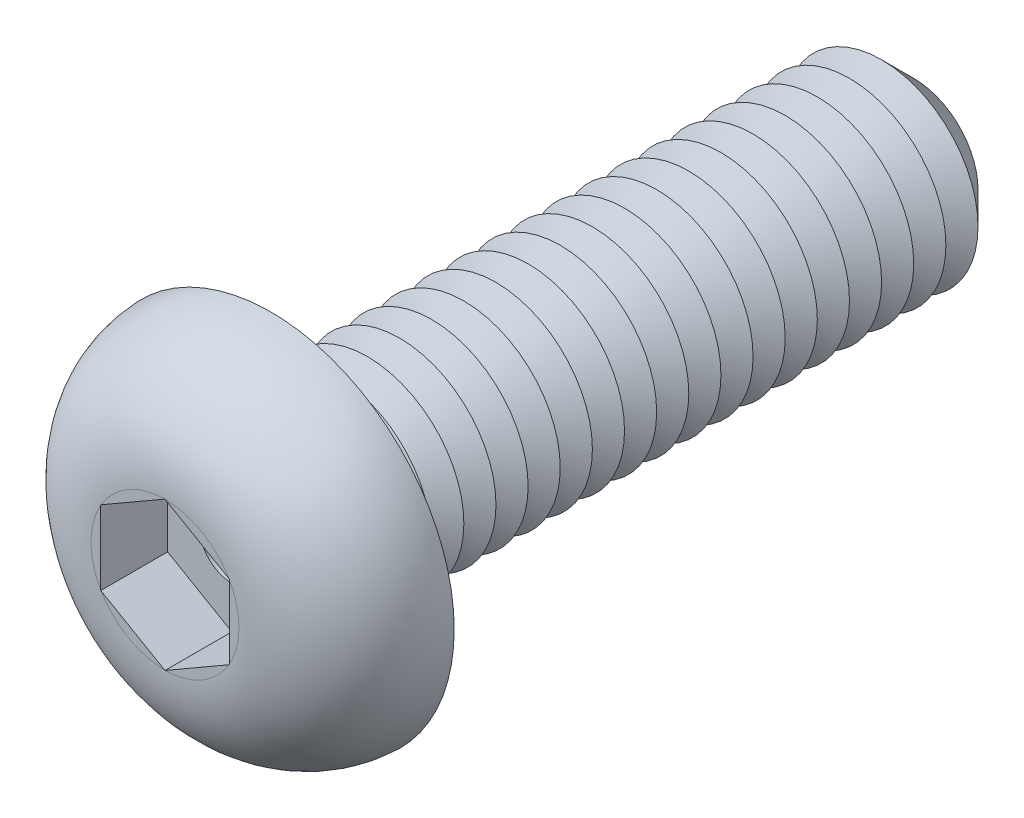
ISO-10303-21;
HEADER;
FILE_DESCRIPTION(('STEP AP214'),'2;1');
FILE_NAME('part.step','',(''),(''),'','','');
FILE_SCHEMA(('AUTOMOTIVE_DESIGN { 1 0 10303 214 1 1 1 1 }'));
ENDSEC;
DATA;
#1=APPLICATION_CONTEXT('core data for automotive mechanical design processes');
#2=APPLICATION_PROTOCOL_DEFINITION('international standard','automotive_design',2000,#1);
#3=PRODUCT_CONTEXT('',#1,'mechanical');
#4=PRODUCT('Part','Part','',(#3));
#5=PRODUCT_RELATED_PRODUCT_CATEGORY('part','',(#4));
#6=PRODUCT_DEFINITION_FORMATION('','',#4);
#7=PRODUCT_DEFINITION_CONTEXT('part definition',#1,'design');
#8=PRODUCT_DEFINITION('design','',#6,#7);
#9=PRODUCT_DEFINITION_SHAPE('','',#8);
#10=(LENGTH_UNIT() NAMED_UNIT(*) SI_UNIT(.MILLI.,.METRE.));
#11=(NAMED_UNIT(*) PLANE_ANGLE_UNIT() SI_UNIT($,.RADIAN.));
#12=(NAMED_UNIT(*) SI_UNIT($,.STERADIAN.) SOLID_ANGLE_UNIT());
#13=UNCERTAINTY_MEASURE_WITH_UNIT(LENGTH_MEASURE(1.E-05),#10,'distance_accuracy_value','');
#14=(GEOMETRIC_REPRESENTATION_CONTEXT(3) GLOBAL_UNCERTAINTY_ASSIGNED_CONTEXT((#13)) GLOBAL_UNIT_ASSIGNED_CONTEXT((#10,
#11,#12)) REPRESENTATION_CONTEXT('',''));
#15=CARTESIAN_POINT('',(0.,0.,0.));
#16=DIRECTION('',(0.,0.,1.));
#17=DIRECTION('',(1.,0.,0.));
#18=AXIS2_PLACEMENT_3D('',#15,#16,#17);
#19=CARTESIAN_POINT('',(0.,0.,-10.));
#20=DIRECTION('',(0.,0.,1.));
#21=DIRECTION('',(1.,0.,0.));
#22=AXIS2_PLACEMENT_3D('',#19,#20,#21);
#23=CYLINDRICAL_SURFACE('',#22,1.5);
#24=CARTESIAN_POINT('',(0.,0.,-0.25));
#25=DIRECTION('',(0.,0.,1.));
#26=DIRECTION('',(1.,0.,0.));
#27=AXIS2_PLACEMENT_3D('',#24,#25,#26);
#28=CIRCLE('',#27,1.5);
#29=CARTESIAN_POINT('',(1.5,0.,-0.25));
#30=VERTEX_POINT('',#29);
#31=EDGE_CURVE('E48',#30,#30,#28,.F.);
#32=ORIENTED_EDGE('',*,*,#31,.T.);
#33=EDGE_LOOP('',(#32));
#34=FACE_BOUND('',#33,.T.);
#35=CARTESIAN_POINT('',(0.,0.,-0.5));
#36=DIRECTION('',(0.,0.,1.));
#37=DIRECTION('',(1.,0.,0.));
#38=AXIS2_PLACEMENT_3D('',#35,#36,#37);
#39=CIRCLE('',#38,1.5);
#40=CARTESIAN_POINT('',(1.5,0.,-0.5));
#41=VERTEX_POINT('',#40);
#42=EDGE_CURVE('E161',#41,#41,#39,.T.);
#43=ORIENTED_EDGE('',*,*,#42,.T.);
#44=EDGE_LOOP('',(#43));
#45=FACE_BOUND('',#44,.T.);
#46=ADVANCED_FACE('F39',(#34,#45),#23,.T.);
#47=CARTESIAN_POINT('',(0.,0.,1.65));
#48=DIRECTION('',(0.,0.,-1.));
#49=DIRECTION('',(-1.,0.,0.));
#50=AXIS2_PLACEMENT_3D('',#47,#48,#49);
#51=PLANE('',#50);
#52=CARTESIAN_POINT('',(0.,0.,1.65));
#53=DIRECTION('',(0.,0.,1.));
#54=DIRECTION('',(1.,0.,0.));
#55=AXIS2_PLACEMENT_3D('',#52,#53,#54);
#56=CIRCLE('',#55,1.15073545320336);
#57=CARTESIAN_POINT('',(0.993096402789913,0.581336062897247,1.65));
#58=VERTEX_POINT('',#57);
#59=CARTESIAN_POINT('',(0.00690359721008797,1.15071474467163,1.65));
#60=VERTEX_POINT('',#59);
#61=EDGE_CURVE('E221',#58,#60,#56,.T.);
#62=ORIENTED_EDGE('',*,*,#61,.T.);
#63=DIRECTION('',(-0.866025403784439,0.5,0.));
#64=VECTOR('',#63,1.);
#65=CARTESIAN_POINT('',(1.,0.577350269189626,1.65));
#66=LINE('',#65,#64);
#67=EDGE_CURVE('E179',#58,#60,#66,.T.);
#68=ORIENTED_EDGE('',*,*,#67,.F.);
#69=EDGE_LOOP('',(#62,#68));
#70=FACE_BOUND('',#69,.T.);
#71=ADVANCED_FACE('F258',(#70),#51,.F.);
#72=CARTESIAN_POINT('',(1.,-0.569378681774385,1.65));
#73=VERTEX_POINT('',#72);
#74=CARTESIAN_POINT('',(1.,0.569378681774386,1.65));
#75=VERTEX_POINT('',#74);
#76=EDGE_CURVE('E216',#73,#75,#56,.T.);
#77=ORIENTED_EDGE('',*,*,#76,.T.);
#78=DIRECTION('',(0.,1.,0.));
#79=VECTOR('',#78,1.);
#80=CARTESIAN_POINT('',(1.,-0.577350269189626,1.65));
#81=LINE('',#80,#79);
#82=EDGE_CURVE('E63',#73,#75,#81,.T.);
#83=ORIENTED_EDGE('',*,*,#82,.F.);
#84=EDGE_LOOP('',(#77,#83));
#85=FACE_BOUND('',#84,.T.);
#86=ADVANCED_FACE('F264',(#85),#51,.F.);
#87=CARTESIAN_POINT('',(0.00690359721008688,-1.15071474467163,1.65));
#88=VERTEX_POINT('',#87);
#89=CARTESIAN_POINT('',(0.993096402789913,-0.581336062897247,1.65));
#90=VERTEX_POINT('',#89);
#91=EDGE_CURVE('E220',#88,#90,#56,.T.);
#92=ORIENTED_EDGE('',*,*,#91,.T.);
#93=DIRECTION('',(0.866025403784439,0.5,0.));
#94=VECTOR('',#93,1.);
#95=CARTESIAN_POINT('',(0.,-1.15470053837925,1.65));
#96=LINE('',#95,#94);
#97=EDGE_CURVE('E191',#88,#90,#96,.T.);
#98=ORIENTED_EDGE('',*,*,#97,.F.);
#99=EDGE_LOOP('',(#92,#98));
#100=FACE_BOUND('',#99,.T.);
#101=ADVANCED_FACE('F327',(#100),#51,.F.);
#102=CARTESIAN_POINT('',(-0.993096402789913,-0.581336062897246,1.65));
#103=VERTEX_POINT('',#102);
#104=CARTESIAN_POINT('',(-0.00690359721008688,-1.15071474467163,1.65));
#105=VERTEX_POINT('',#104);
#106=EDGE_CURVE('E337',#103,#105,#56,.T.);
#107=ORIENTED_EDGE('',*,*,#106,.T.);
#108=DIRECTION('',(0.866025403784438,-0.5,0.));
#109=VECTOR('',#108,1.);
#110=CARTESIAN_POINT('',(-1.,-0.577350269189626,1.65));
#111=LINE('',#110,#109);
#112=EDGE_CURVE('E187',#103,#105,#111,.T.);
#113=ORIENTED_EDGE('',*,*,#112,.F.);
#114=EDGE_LOOP('',(#107,#113));
#115=FACE_BOUND('',#114,.T.);
#116=ADVANCED_FACE('F322',(#115),#51,.F.);
#117=CARTESIAN_POINT('',(-1.,0.569378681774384,1.65));
#118=VERTEX_POINT('',#117);
#119=CARTESIAN_POINT('',(-1.,-0.569378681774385,1.65));
#120=VERTEX_POINT('',#119);
#121=EDGE_CURVE('E332',#118,#120,#56,.T.);
#122=ORIENTED_EDGE('',*,*,#121,.T.);
#123=DIRECTION('',(0.,-1.,0.));
#124=VECTOR('',#123,1.);
#125=CARTESIAN_POINT('',(-1.,0.577350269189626,1.65));
#126=LINE('',#125,#124);
#127=EDGE_CURVE('E183',#118,#120,#126,.T.);
#128=ORIENTED_EDGE('',*,*,#127,.F.);
#129=EDGE_LOOP('',(#122,#128));
#130=FACE_BOUND('',#129,.T.);
#131=ADVANCED_FACE('F313',(#130),#51,.F.);
#132=CARTESIAN_POINT('',(0.,2.85,0.));
#133=DIRECTION('',(0.,0.,1.));
#134=DIRECTION('',(1.,0.,0.));
#135=AXIS2_PLACEMENT_3D('',#132,#133,#134);
#136=PLANE('',#135);
#137=CARTESIAN_POINT('',(0.,0.,0.));
#138=DIRECTION('',(0.,0.,1.));
#139=DIRECTION('',(1.,0.,0.));
#140=AXIS2_PLACEMENT_3D('',#137,#138,#139);
#141=CIRCLE('',#140,1.75);
#142=CARTESIAN_POINT('',(1.75,0.,0.));
#143=VERTEX_POINT('',#142);
#144=EDGE_CURVE('E11',#143,#143,#141,.T.);
#145=ORIENTED_EDGE('',*,*,#144,.T.);
#146=EDGE_LOOP('',(#145));
#147=FACE_BOUND('',#146,.T.);
#148=CARTESIAN_POINT('',(0.,0.,0.));
#149=DIRECTION('',(0.,0.,1.));
#150=DIRECTION('',(1.,0.,0.));
#151=AXIS2_PLACEMENT_3D('',#148,#149,#150);
#152=CIRCLE('',#151,2.85);
#153=CARTESIAN_POINT('',(2.85,0.,0.));
#154=VERTEX_POINT('',#153);
#155=EDGE_CURVE('E198',#154,#154,#152,.T.);
#156=ORIENTED_EDGE('',*,*,#155,.F.);
#157=EDGE_LOOP('',(#156));
#158=FACE_BOUND('',#157,.T.);
#159=ADVANCED_FACE('F310',(#147,#158),#136,.F.);
#160=CARTESIAN_POINT('',(-0.00690359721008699,1.15071474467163,1.65));
#161=VERTEX_POINT('',#160);
#162=CARTESIAN_POINT('',(-0.993096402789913,0.581336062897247,1.65));
#163=VERTEX_POINT('',#162);
#164=EDGE_CURVE('E336',#161,#163,#56,.T.);
#165=ORIENTED_EDGE('',*,*,#164,.T.);
#166=DIRECTION('',(-0.866025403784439,-0.5,0.));
#167=VECTOR('',#166,1.);
#168=CARTESIAN_POINT('',(0.,1.15470053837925,1.65));
#169=LINE('',#168,#167);
#170=EDGE_CURVE('E178',#161,#163,#169,.T.);
#171=ORIENTED_EDGE('',*,*,#170,.F.);
#172=EDGE_LOOP('',(#165,#171));
#173=FACE_BOUND('',#172,.T.);
#174=ADVANCED_FACE('F255',(#173),#51,.F.);
#175=CARTESIAN_POINT('',(0.,0.,-0.0499999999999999));
#176=DIRECTION('',(0.,0.,1.));
#177=DIRECTION('',(1.,0.,0.));
#178=AXIS2_PLACEMENT_3D('',#175,#176,#177);
#179=DEGENERATE_TOROIDAL_SURFACE('',#178,1.15073545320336,1.7,.T.);
#180=ORIENTED_EDGE('',*,*,#61,.F.);
#181=CARTESIAN_POINT('',(1.,0.577350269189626,1.65));
#182=VERTEX_POINT('',#181);
#183=EDGE_CURVE('E175',#182,#58,#66,.T.);
#184=ORIENTED_EDGE('',*,*,#183,.F.);
#185=CARTESIAN_POINT('',(1.,0.,1.64330411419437));
#186=CARTESIAN_POINT('',(1.,-0.0418495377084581,1.64330316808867));
#187=CARTESIAN_POINT('',(1.,-0.0836989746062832,1.64354559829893));
#188=CARTESIAN_POINT('',(1.,-0.167393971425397,1.64442358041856));
#189=CARTESIAN_POINT('',(1.,-0.209239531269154,1.64505913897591));
#190=CARTESIAN_POINT('',(1.,-0.334845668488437,1.64722576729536));
#191=CARTESIAN_POINT('',(1.,-0.418601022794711,1.64901611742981));
#192=CARTESIAN_POINT('',(1.,-0.585792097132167,1.65039211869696));
#193=CARTESIAN_POINT('',(1.,-0.669227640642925,1.64998722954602));
#194=CARTESIAN_POINT('',(1.,-0.83590094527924,1.6440300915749));
#195=CARTESIAN_POINT('',(1.,-0.919138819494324,1.63848280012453));
#196=CARTESIAN_POINT('',(1.,-1.0594136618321,1.62282805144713));
#197=CARTESIAN_POINT('',(1.,-1.11666006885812,1.61463991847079));
#198=CARTESIAN_POINT('',(1.,-1.23041128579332,1.59417176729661));
#199=CARTESIAN_POINT('',(1.,-1.2869163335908,1.58189309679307));
#200=CARTESIAN_POINT('',(1.,-1.39883762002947,1.55283610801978));
#201=CARTESIAN_POINT('',(1.,-1.45425254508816,1.53605268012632));
#202=CARTESIAN_POINT('',(1.,-1.56342884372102,1.49775525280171));
#203=CARTESIAN_POINT('',(1.,-1.61719032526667,1.47624156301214));
#204=CARTESIAN_POINT('',(1.,-1.72305248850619,1.42814032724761));
#205=CARTESIAN_POINT('',(1.,-1.77513121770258,1.40150424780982));
#206=CARTESIAN_POINT('',(1.,-1.87650034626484,1.34331391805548));
#207=CARTESIAN_POINT('',(1.,-1.92578956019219,1.31175759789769));
#208=CARTESIAN_POINT('',(1.,-2.02094663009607,1.24389579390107));
#209=CARTESIAN_POINT('',(1.,-2.06681670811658,1.20759343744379));
#210=CARTESIAN_POINT('',(1.,-2.15460705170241,1.13048515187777));
#211=CARTESIAN_POINT('',(1.,-2.19652613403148,1.08967788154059));
#212=CARTESIAN_POINT('',(1.,-2.30373588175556,0.973753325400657));
#213=CARTESIAN_POINT('',(1.,-2.36480639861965,0.894640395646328));
#214=CARTESIAN_POINT('',(1.,-2.47150299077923,0.726696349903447));
#215=CARTESIAN_POINT('',(1.,-2.51713890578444,0.637871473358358));
#216=CARTESIAN_POINT('',(1.,-2.58857066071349,0.46005750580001));
#217=CARTESIAN_POINT('',(1.,-2.61556805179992,0.371550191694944));
#218=CARTESIAN_POINT('',(1.,-2.65390085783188,0.191213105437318));
#219=CARTESIAN_POINT('',(1.,-2.66523955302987,0.0993840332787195));
#220=CARTESIAN_POINT('',(1.,-2.67179092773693,-0.0825708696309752));
#221=CARTESIAN_POINT('',(1.,-2.66739421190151,-0.17268289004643));
#222=CARTESIAN_POINT('',(1.,-2.64348567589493,-0.350883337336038));
#223=CARTESIAN_POINT('',(1.,-2.62397312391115,-0.438971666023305));
#224=CARTESIAN_POINT('',(1.,-2.57054048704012,-0.610404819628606));
#225=CARTESIAN_POINT('',(1.,-2.53665793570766,-0.693761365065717));
#226=CARTESIAN_POINT('',(1.,-2.45559893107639,-0.85368978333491));
#227=CARTESIAN_POINT('',(1.,-2.40842683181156,-0.930263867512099));
#228=CARTESIAN_POINT('',(1.,-2.30144802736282,-1.07583692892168));
#229=CARTESIAN_POINT('',(1.,-2.24145688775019,-1.14470015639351));
#230=CARTESIAN_POINT('',(1.,-2.11112251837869,-1.27193159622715));
#231=CARTESIAN_POINT('',(1.,-2.04076746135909,-1.33028764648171));
#232=CARTESIAN_POINT('',(1.,-1.88862864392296,-1.43765509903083));
#233=CARTESIAN_POINT('',(1.,-1.80648025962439,-1.48614793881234));
#234=CARTESIAN_POINT('',(1.,-1.63600727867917,-1.56989445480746));
#235=CARTESIAN_POINT('',(1.,-1.54769931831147,-1.60518226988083));
#236=CARTESIAN_POINT('',(1.,-1.39091080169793,-1.65552596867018));
#237=CARTESIAN_POINT('',(1.,-1.32332513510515,-1.67346211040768));
#238=CARTESIAN_POINT('',(1.,-1.18678249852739,-1.70305339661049));
#239=CARTESIAN_POINT('',(1.,-1.11782507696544,-1.71470643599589));
#240=CARTESIAN_POINT('',(1.,-0.978842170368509,-1.73262758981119));
#241=CARTESIAN_POINT('',(1.,-0.908812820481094,-1.73886428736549));
#242=CARTESIAN_POINT('',(1.,-0.768519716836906,-1.74708473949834));
#243=CARTESIAN_POINT('',(1.,-0.698255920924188,-1.74906768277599));
#244=CARTESIAN_POINT('',(1.,-0.527772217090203,-1.75068316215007));
#245=CARTESIAN_POINT('',(1.,-0.427552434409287,-1.74895318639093));
#246=CARTESIAN_POINT('',(1.,-0.27725595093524,-1.74623781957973));
#247=CARTESIAN_POINT('',(1.,-0.227169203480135,-1.74531275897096));
#248=CARTESIAN_POINT('',(1.,-0.126990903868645,-1.74392135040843));
#249=CARTESIAN_POINT('',(1.,-0.0768993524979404,-1.74345496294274));
#250=CARTESIAN_POINT('',(1.,0.02329543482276,-1.7432171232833));
#251=CARTESIAN_POINT('',(1.,0.073398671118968,-1.74344580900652));
#252=CARTESIAN_POINT('',(1.,0.173601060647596,-1.74448066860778));
#253=CARTESIAN_POINT('',(1.,0.223700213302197,-1.74528688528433));
#254=CARTESIAN_POINT('',(1.,0.374032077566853,-1.74796102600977));
#255=CARTESIAN_POINT('',(1.,0.474263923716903,-1.7500840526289));
#256=CARTESIAN_POINT('',(1.,0.646038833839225,-1.74993675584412));
#257=CARTESIAN_POINT('',(1.,0.717572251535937,-1.74875105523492));
#258=CARTESIAN_POINT('',(1.,0.860467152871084,-1.74232930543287));
#259=CARTESIAN_POINT('',(0.999999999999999,0.931828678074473,-1.73709436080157));
#260=CARTESIAN_POINT('',(0.999999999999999,1.07356885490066,-1.72122033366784));
#261=CARTESIAN_POINT('',(0.999999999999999,1.14395079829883,-1.71061248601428));
#262=CARTESIAN_POINT('',(0.999999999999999,1.28345101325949,-1.6830362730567));
#263=CARTESIAN_POINT('',(0.999999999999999,1.35256960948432,-1.66606956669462));
#264=CARTESIAN_POINT('',(0.999999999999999,1.51915230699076,-1.61597650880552));
#265=CARTESIAN_POINT('',(0.999999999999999,1.61551282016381,-1.5790180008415));
#266=CARTESIAN_POINT('',(0.999999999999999,1.80117858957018,-1.48957694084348));
#267=CARTESIAN_POINT('',(0.999999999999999,1.89046083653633,-1.43704619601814));
#268=CARTESIAN_POINT('',(0.999999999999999,2.05877104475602,-1.31682583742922));
#269=CARTESIAN_POINT('',(0.999999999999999,2.13775712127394,-1.24907718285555));
#270=CARTESIAN_POINT('',(0.999999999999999,2.28184060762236,-1.10027015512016));
#271=CARTESIAN_POINT('',(0.999999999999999,2.34695771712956,-1.01923095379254));
#272=CARTESIAN_POINT('',(0.999999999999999,2.45608578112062,-0.853423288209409));
#273=CARTESIAN_POINT('',(0.999999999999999,2.5013878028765,-0.769502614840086));
#274=CARTESIAN_POINT('',(0.999999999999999,2.5765359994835,-0.594973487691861));
#275=CARTESIAN_POINT('',(0.999999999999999,2.60638146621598,-0.504364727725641));
#276=CARTESIAN_POINT('',(0.999999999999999,2.64857466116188,-0.323348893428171));
#277=CARTESIAN_POINT('',(0.999999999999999,2.66163020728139,-0.2331061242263));
#278=CARTESIAN_POINT('',(0.999999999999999,2.67217366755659,-0.0517287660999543));
#279=CARTESIAN_POINT('',(0.999999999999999,2.66966509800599,0.0394056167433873));
#280=CARTESIAN_POINT('',(0.999999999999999,2.64931179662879,0.218675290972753));
#281=CARTESIAN_POINT('',(0.999999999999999,2.63167707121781,0.306834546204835));
#282=CARTESIAN_POINT('',(0.999999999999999,2.58192713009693,0.478965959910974));
#283=CARTESIAN_POINT('',(0.999999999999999,2.54981137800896,0.562937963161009));
#284=CARTESIAN_POINT('',(0.999999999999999,2.47193161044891,0.724823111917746));
#285=CARTESIAN_POINT('',(0.999999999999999,2.42609746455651,0.802702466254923));
#286=CARTESIAN_POINT('',(0.999999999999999,2.32231485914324,0.949889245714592));
#287=CARTESIAN_POINT('',(0.999999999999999,2.26436747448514,1.01919743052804));
#288=CARTESIAN_POINT('',(0.999999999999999,2.13654618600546,1.14929270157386));
#289=CARTESIAN_POINT('',(0.999999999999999,2.0664051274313,1.20981647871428));
#290=CARTESIAN_POINT('',(0.999999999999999,1.9173872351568,1.31904487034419));
#291=CARTESIAN_POINT('',(0.999999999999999,1.83850453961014,1.36774148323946));
#292=CARTESIAN_POINT('',(0.999999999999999,1.71289874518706,1.4328215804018));
#293=CARTESIAN_POINT('',(0.999999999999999,1.66841297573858,1.45365843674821));
#294=CARTESIAN_POINT('',(0.999999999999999,1.57796501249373,1.49187589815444));
#295=CARTESIAN_POINT('',(0.999999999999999,1.53200259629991,1.50925597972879));
#296=CARTESIAN_POINT('',(0.999999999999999,1.43903939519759,1.54059227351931));
#297=CARTESIAN_POINT('',(0.999999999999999,1.39204097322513,1.55455554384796));
#298=CARTESIAN_POINT('',(0.999999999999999,1.29722920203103,1.57925913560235));
#299=CARTESIAN_POINT('',(0.999999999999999,1.24941611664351,1.59000048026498));
#300=CARTESIAN_POINT('',(0.999999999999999,1.10320842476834,1.61808076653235));
#301=CARTESIAN_POINT('',(0.999999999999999,1.00389041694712,1.63067408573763));
#302=CARTESIAN_POINT('',(0.999999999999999,0.804462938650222,1.6463207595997));
#303=CARTESIAN_POINT('',(1.,0.704352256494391,1.64935433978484));
#304=CARTESIAN_POINT('',(1.,0.503474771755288,1.65046619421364));
#305=CARTESIAN_POINT('',(0.999999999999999,0.402708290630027,1.64850957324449));
#306=CARTESIAN_POINT('',(1.,0.251622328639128,1.64577086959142));
#307=CARTESIAN_POINT('',(1.,0.201301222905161,1.64489114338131));
#308=CARTESIAN_POINT('',(1.,0.100653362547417,1.64365834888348));
#309=CARTESIAN_POINT('',(1.,0.0503266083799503,1.64330525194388));
#310=CARTESIAN_POINT('',(1.,0.,1.64330411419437));
#311=B_SPLINE_CURVE_WITH_KNOTS('',3,(#185,#186,#187,#188,#189,#190,#191,#192,#193,#194,#195,
#196,#197,#198,#199,#200,#201,#202,#203,#204,#205,#206,#207,#208,#209,#210,#211,#212,#213,#214,
#215,#216,#217,#218,#219,#220,#221,#222,#223,#224,#225,#226,#227,#228,#229,#230,#231,#232,#233,
#234,#235,#236,#237,#238,#239,#240,#241,#242,#243,#244,#245,#246,#247,#248,#249,#250,#251,#252,
#253,#254,#255,#256,#257,#258,#259,#260,#261,#262,#263,#264,#265,#266,#267,#268,#269,#270,#271,
#272,#273,#274,#275,#276,#277,#278,#279,#280,#281,#282,#283,#284,#285,#286,#287,#288,#289,#290,
#291,#292,#293,#294,#295,#296,#297,#298,#299,#300,#301,#302,#303,#304,#305,#306,#307,#308,#309,
#310),.UNSPECIFIED.,.T.,.F.,(4,2,2,2,2,2,2,2,2,2,2,2,2,2,2,2,2,2,2,2,2,2,2,2,2,2,2,2,2,2,2,2,2,
2,2,2,2,2,2,2,2,2,2,2,2,2,2,2,2,2,2,2,2,2,2,2,2,2,2,2,2,2,4),(0.,0.125547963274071,
0.251098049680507,0.502422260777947,0.752664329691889,1.00266541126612,1.17602519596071,
1.34932792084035,1.52282805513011,1.69631683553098,1.87153849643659,2.04683406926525,
2.22201470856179,2.39724764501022,2.69534138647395,2.99324473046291,3.26948200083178,
3.54566139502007,3.81503317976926,4.08441800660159,4.35310350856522,4.62170108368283,
4.89446026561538,5.16753316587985,5.45251589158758,5.73675667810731,5.94622800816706,
6.15576947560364,6.3665183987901,6.57730751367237,6.87796487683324,7.02825425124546,
7.17853067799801,7.32883692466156,7.47915431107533,7.77989491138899,7.99445526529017,
8.20895711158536,8.42222604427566,8.63543937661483,8.94372593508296,9.25297671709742,
9.56344868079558,9.87347666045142,10.1581355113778,10.4428074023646,10.715036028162,
10.9872031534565,11.2556516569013,11.5241101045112,11.7939650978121,12.0637961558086,
12.3405292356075,12.6174490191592,12.7646985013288,12.9119702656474,13.0589351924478,
13.2058533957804,13.5054664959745,13.8056989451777,14.1080365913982,14.2590238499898,
14.410002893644),.UNSPECIFIED.);
#312=EDGE_CURVE('E279',#182,#75,#311,.T.);
#313=ORIENTED_EDGE('',*,*,#312,.T.);
#314=ORIENTED_EDGE('',*,*,#76,.F.);
#315=CARTESIAN_POINT('',(1.,-0.577350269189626,1.65));
#316=VERTEX_POINT('',#315);
#317=EDGE_CURVE('E154',#316,#73,#81,.T.);
#318=ORIENTED_EDGE('',*,*,#317,.F.);
#319=CARTESIAN_POINT('',(1.0002,-0.577234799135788,1.64999510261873));
#320=CARTESIAN_POINT('',(0.958507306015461,-0.601306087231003,1.65004608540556));
#321=CARTESIAN_POINT('',(0.916820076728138,-0.625374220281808,1.64959104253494));
#322=CARTESIAN_POINT('',(0.83344664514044,-0.673509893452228,1.64822305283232));
#323=CARTESIAN_POINT('',(0.791760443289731,-0.697577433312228,1.6473100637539));
#324=CARTESIAN_POINT('',(0.708395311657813,-0.745708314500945,1.64558069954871));
#325=CARTESIAN_POINT('',(0.666716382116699,-0.769771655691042,1.64476430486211));
#326=CARTESIAN_POINT('',(0.58335598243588,-0.817899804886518,1.64362601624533));
#327=CARTESIAN_POINT('',(0.541674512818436,-0.841964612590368,1.64330408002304));
#328=CARTESIAN_POINT('',(0.45831273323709,-0.890093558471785,1.64330414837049));
#329=CARTESIAN_POINT('',(0.416632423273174,-0.914157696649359,1.64362613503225));
#330=CARTESIAN_POINT('',(0.333274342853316,-0.962284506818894,1.64476447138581));
#331=CARTESIAN_POINT('',(0.291596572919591,-0.986347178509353,1.64558086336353));
#332=CARTESIAN_POINT('',(0.208233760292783,-1.03447672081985,1.64731018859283));
#333=CARTESIAN_POINT('',(0.166548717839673,-1.05854359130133,1.64822314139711));
#334=CARTESIAN_POINT('',(0.0831776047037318,-1.106677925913,1.64959106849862));
#335=CARTESIAN_POINT('',(0.0414915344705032,-1.13074538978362,1.65004608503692));
#336=CARTESIAN_POINT('',(-0.00020000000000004,-1.15481600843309,1.64999510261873));
#337=B_SPLINE_CURVE_WITH_KNOTS('',3,(#319,#320,#321,#322,#323,#324,#325,#326,#327,#328,#329,
#330,#331,#332,#333,#334,#335,#336),.UNSPECIFIED.,.F.,.F.,(4,2,2,2,2,2,2,2,4),(0.,
0.144416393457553,0.288846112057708,0.433246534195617,0.577634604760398,0.722018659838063,
0.866415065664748,1.01084076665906,1.15525314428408),.UNSPECIFIED.);
#338=EDGE_CURVE('E286',#316,#90,#337,.T.);
#339=ORIENTED_EDGE('',*,*,#338,.T.);
#340=ORIENTED_EDGE('',*,*,#91,.F.);
#341=CARTESIAN_POINT('',(0.,-1.15470053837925,1.65));
#342=VERTEX_POINT('',#341);
#343=EDGE_CURVE('E192',#342,#88,#96,.T.);
#344=ORIENTED_EDGE('',*,*,#343,.F.);
#345=CARTESIAN_POINT('',(0.000199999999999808,-1.15481600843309,1.64999510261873));
#346=CARTESIAN_POINT('',(-0.0414926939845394,-1.13074472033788,1.65004608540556));
#347=CARTESIAN_POINT('',(-0.0831799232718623,-1.10667658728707,1.64959104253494));
#348=CARTESIAN_POINT('',(-0.166553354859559,-1.05854091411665,1.64822305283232));
#349=CARTESIAN_POINT('',(-0.208239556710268,-1.03447337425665,1.6473100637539));
#350=CARTESIAN_POINT('',(-0.291604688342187,-0.986342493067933,1.64558069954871));
#351=CARTESIAN_POINT('',(-0.333283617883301,-0.962279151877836,1.64476430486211));
#352=CARTESIAN_POINT('',(-0.41664401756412,-0.91415100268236,1.64362601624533));
#353=CARTESIAN_POINT('',(-0.458325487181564,-0.89008619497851,1.64330408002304));
#354=CARTESIAN_POINT('',(-0.54168726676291,-0.841957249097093,1.64330414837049));
#355=CARTESIAN_POINT('',(-0.583367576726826,-0.817893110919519,1.64362613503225));
#356=CARTESIAN_POINT('',(-0.666725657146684,-0.769766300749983,1.64476447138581));
#357=CARTESIAN_POINT('',(-0.708403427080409,-0.745703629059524,1.64558086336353));
#358=CARTESIAN_POINT('',(-0.791766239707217,-0.697574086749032,1.64731018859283));
#359=CARTESIAN_POINT('',(-0.833451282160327,-0.673507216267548,1.64822314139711));
#360=CARTESIAN_POINT('',(-0.916822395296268,-0.625372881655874,1.64959106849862));
#361=CARTESIAN_POINT('',(-0.958508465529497,-0.601305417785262,1.65004608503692));
#362=CARTESIAN_POINT('',(-1.0002,-0.577234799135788,1.64999510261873));
#363=B_SPLINE_CURVE_WITH_KNOTS('',3,(#345,#346,#347,#348,#349,#350,#351,#352,#353,#354,#355,
#356,#357,#358,#359,#360,#361,#362),.UNSPECIFIED.,.F.,.F.,(4,2,2,2,2,2,2,2,4),(0.,
0.144416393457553,0.288846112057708,0.433246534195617,0.577634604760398,0.722018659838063,
0.866415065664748,1.01084076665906,1.15525314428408),.UNSPECIFIED.);
#364=EDGE_CURVE('E361',#342,#105,#363,.T.);
#365=ORIENTED_EDGE('',*,*,#364,.T.);
#366=ORIENTED_EDGE('',*,*,#106,.F.);
#367=CARTESIAN_POINT('',(-1.,-0.577350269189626,1.65));
#368=VERTEX_POINT('',#367);
#369=EDGE_CURVE('E188',#368,#103,#111,.T.);
#370=ORIENTED_EDGE('',*,*,#369,.F.);
#371=CARTESIAN_POINT('',(-1.,0.,1.64330411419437));
#372=CARTESIAN_POINT('',(-1.,0.0418495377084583,1.64330316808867));
#373=CARTESIAN_POINT('',(-1.,0.0836989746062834,1.64354559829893));
#374=CARTESIAN_POINT('',(-1.,0.167393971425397,1.64442358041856));
#375=CARTESIAN_POINT('',(-1.,0.209239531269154,1.64505913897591));
#376=CARTESIAN_POINT('',(-1.,0.334845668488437,1.64722576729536));
#377=CARTESIAN_POINT('',(-1.,0.418601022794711,1.64901611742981));
#378=CARTESIAN_POINT('',(-1.,0.585792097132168,1.65039211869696));
#379=CARTESIAN_POINT('',(-1.,0.669227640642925,1.64998722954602));
#380=CARTESIAN_POINT('',(-1.,0.835900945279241,1.6440300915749));
#381=CARTESIAN_POINT('',(-1.,0.919138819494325,1.63848280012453));
#382=CARTESIAN_POINT('',(-1.,1.0594136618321,1.62282805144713));
#383=CARTESIAN_POINT('',(-1.,1.11666006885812,1.61463991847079));
#384=CARTESIAN_POINT('',(-1.,1.23041128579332,1.59417176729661));
#385=CARTESIAN_POINT('',(-1.,1.2869163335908,1.58189309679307));
#386=CARTESIAN_POINT('',(-1.,1.39883762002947,1.55283610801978));
#387=CARTESIAN_POINT('',(-1.,1.45425254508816,1.53605268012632));
#388=CARTESIAN_POINT('',(-1.,1.56342884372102,1.49775525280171));
#389=CARTESIAN_POINT('',(-1.,1.61719032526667,1.47624156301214));
#390=CARTESIAN_POINT('',(-1.,1.72305248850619,1.42814032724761));
#391=CARTESIAN_POINT('',(-1.,1.77513121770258,1.40150424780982));
#392=CARTESIAN_POINT('',(-1.,1.87650034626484,1.34331391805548));
#393=CARTESIAN_POINT('',(-1.,1.92578956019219,1.31175759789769));
#394=CARTESIAN_POINT('',(-1.,2.02094663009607,1.24389579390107));
#395=CARTESIAN_POINT('',(-1.,2.06681670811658,1.20759343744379));
#396=CARTESIAN_POINT('',(-1.,2.15460705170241,1.13048515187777));
#397=CARTESIAN_POINT('',(-1.,2.19652613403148,1.08967788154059));
#398=CARTESIAN_POINT('',(-1.,2.30373588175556,0.973753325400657));
#399=CARTESIAN_POINT('',(-1.,2.36480639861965,0.894640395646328));
#400=CARTESIAN_POINT('',(-1.,2.47150299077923,0.726696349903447));
#401=CARTESIAN_POINT('',(-1.,2.51713890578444,0.637871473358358));
#402=CARTESIAN_POINT('',(-1.,2.58857066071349,0.46005750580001));
#403=CARTESIAN_POINT('',(-1.,2.61556805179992,0.371550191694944));
#404=CARTESIAN_POINT('',(-1.,2.65390085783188,0.191213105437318));
#405=CARTESIAN_POINT('',(-1.,2.66523955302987,0.0993840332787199));
#406=CARTESIAN_POINT('',(-1.,2.67179092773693,-0.0825708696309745));
#407=CARTESIAN_POINT('',(-1.,2.66739421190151,-0.17268289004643));
#408=CARTESIAN_POINT('',(-1.,2.64348567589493,-0.350883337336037));
#409=CARTESIAN_POINT('',(-1.,2.62397312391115,-0.438971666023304));
#410=CARTESIAN_POINT('',(-1.,2.57054048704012,-0.610404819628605));
#411=CARTESIAN_POINT('',(-1.,2.53665793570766,-0.693761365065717));
#412=CARTESIAN_POINT('',(-1.,2.45559893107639,-0.853689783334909));
#413=CARTESIAN_POINT('',(-1.,2.40842683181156,-0.930263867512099));
#414=CARTESIAN_POINT('',(-1.,2.30144802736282,-1.07583692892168));
#415=CARTESIAN_POINT('',(-1.,2.24145688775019,-1.14470015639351));
#416=CARTESIAN_POINT('',(-1.,2.11112251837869,-1.27193159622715));
#417=CARTESIAN_POINT('',(-1.,2.04076746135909,-1.33028764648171));
#418=CARTESIAN_POINT('',(-1.,1.88862864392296,-1.43765509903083));
#419=CARTESIAN_POINT('',(-1.,1.80648025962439,-1.48614793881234));
#420=CARTESIAN_POINT('',(-1.,1.63600727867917,-1.56989445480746));
#421=CARTESIAN_POINT('',(-1.,1.54769931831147,-1.60518226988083));
#422=CARTESIAN_POINT('',(-1.,1.39091080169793,-1.65552596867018));
#423=CARTESIAN_POINT('',(-1.,1.32332513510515,-1.67346211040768));
#424=CARTESIAN_POINT('',(-1.,1.18678249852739,-1.70305339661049));
#425=CARTESIAN_POINT('',(-1.,1.11782507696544,-1.71470643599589));
#426=CARTESIAN_POINT('',(-1.,0.97884217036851,-1.73262758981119));
#427=CARTESIAN_POINT('',(-1.,0.908812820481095,-1.73886428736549));
#428=CARTESIAN_POINT('',(-1.,0.768519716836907,-1.74708473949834));
#429=CARTESIAN_POINT('',(-1.,0.698255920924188,-1.74906768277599));
#430=CARTESIAN_POINT('',(-1.,0.527772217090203,-1.75068316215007));
#431=CARTESIAN_POINT('',(-1.,0.427552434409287,-1.74895318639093));
#432=CARTESIAN_POINT('',(-1.,0.27725595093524,-1.74623781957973));
#433=CARTESIAN_POINT('',(-1.,0.227169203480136,-1.74531275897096));
#434=CARTESIAN_POINT('',(-1.,0.126990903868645,-1.74392135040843));
#435=CARTESIAN_POINT('',(-1.,0.0768993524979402,-1.74345496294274));
#436=CARTESIAN_POINT('',(-1.,-0.0232954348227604,-1.7432171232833));
#437=CARTESIAN_POINT('',(-1.,-0.0733986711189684,-1.74344580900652));
#438=CARTESIAN_POINT('',(-1.,-0.173601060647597,-1.74448066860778));
#439=CARTESIAN_POINT('',(-1.,-0.223700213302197,-1.74528688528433));
#440=CARTESIAN_POINT('',(-1.,-0.374032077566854,-1.74796102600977));
#441=CARTESIAN_POINT('',(-1.,-0.474263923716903,-1.7500840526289));
#442=CARTESIAN_POINT('',(-1.,-0.646038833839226,-1.74993675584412));
#443=CARTESIAN_POINT('',(-1.,-0.717572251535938,-1.74875105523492));
#444=CARTESIAN_POINT('',(-1.,-0.860467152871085,-1.74232930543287));
#445=CARTESIAN_POINT('',(-1.,-0.931828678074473,-1.73709436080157));
#446=CARTESIAN_POINT('',(-1.,-1.07356885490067,-1.72122033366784));
#447=CARTESIAN_POINT('',(-1.,-1.14395079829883,-1.71061248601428));
#448=CARTESIAN_POINT('',(-1.,-1.28345101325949,-1.6830362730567));
#449=CARTESIAN_POINT('',(-1.,-1.35256960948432,-1.66606956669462));
#450=CARTESIAN_POINT('',(-1.,-1.51915230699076,-1.61597650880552));
#451=CARTESIAN_POINT('',(-1.,-1.61551282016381,-1.5790180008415));
#452=CARTESIAN_POINT('',(-1.,-1.80117858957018,-1.48957694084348));
#453=CARTESIAN_POINT('',(-1.,-1.89046083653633,-1.43704619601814));
#454=CARTESIAN_POINT('',(-1.,-2.05877104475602,-1.31682583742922));
#455=CARTESIAN_POINT('',(-0.999999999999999,-2.13775712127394,-1.24907718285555));
#456=CARTESIAN_POINT('',(-0.999999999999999,-2.28184060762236,-1.10027015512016));
#457=CARTESIAN_POINT('',(-0.999999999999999,-2.34695771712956,-1.01923095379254));
#458=CARTESIAN_POINT('',(-0.999999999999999,-2.45608578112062,-0.85342328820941));
#459=CARTESIAN_POINT('',(-0.999999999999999,-2.50138780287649,-0.769502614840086));
#460=CARTESIAN_POINT('',(-0.999999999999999,-2.5765359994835,-0.594973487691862));
#461=CARTESIAN_POINT('',(-0.999999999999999,-2.60638146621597,-0.504364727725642));
#462=CARTESIAN_POINT('',(-0.999999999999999,-2.64857466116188,-0.323348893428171));
#463=CARTESIAN_POINT('',(-0.999999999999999,-2.66163020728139,-0.2331061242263));
#464=CARTESIAN_POINT('',(-0.999999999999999,-2.67217366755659,-0.0517287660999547));
#465=CARTESIAN_POINT('',(-0.999999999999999,-2.66966509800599,0.0394056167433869));
#466=CARTESIAN_POINT('',(-0.999999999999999,-2.64931179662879,0.218675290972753));
#467=CARTESIAN_POINT('',(-0.999999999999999,-2.63167707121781,0.306834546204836));
#468=CARTESIAN_POINT('',(-0.999999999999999,-2.58192713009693,0.478965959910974));
#469=CARTESIAN_POINT('',(-0.999999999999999,-2.54981137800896,0.562937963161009));
#470=CARTESIAN_POINT('',(-0.999999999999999,-2.47193161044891,0.724823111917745));
#471=CARTESIAN_POINT('',(-0.999999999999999,-2.42609746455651,0.802702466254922));
#472=CARTESIAN_POINT('',(-0.999999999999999,-2.32231485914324,0.949889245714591));
#473=CARTESIAN_POINT('',(-0.999999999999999,-2.26436747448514,1.01919743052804));
#474=CARTESIAN_POINT('',(-0.999999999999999,-2.13654618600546,1.14929270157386));
#475=CARTESIAN_POINT('',(-1.,-2.06640512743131,1.20981647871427));
#476=CARTESIAN_POINT('',(-1.,-1.9173872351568,1.31904487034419));
#477=CARTESIAN_POINT('',(-1.,-1.83850453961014,1.36774148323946));
#478=CARTESIAN_POINT('',(-1.,-1.71289874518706,1.4328215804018));
#479=CARTESIAN_POINT('',(-1.,-1.66841297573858,1.45365843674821));
#480=CARTESIAN_POINT('',(-1.,-1.57796501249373,1.49187589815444));
#481=CARTESIAN_POINT('',(-1.,-1.53200259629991,1.50925597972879));
#482=CARTESIAN_POINT('',(-1.,-1.43903939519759,1.54059227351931));
#483=CARTESIAN_POINT('',(-1.,-1.39204097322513,1.55455554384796));
#484=CARTESIAN_POINT('',(-1.,-1.29722920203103,1.57925913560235));
#485=CARTESIAN_POINT('',(-1.,-1.24941611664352,1.59000048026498));
#486=CARTESIAN_POINT('',(-1.,-1.10320842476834,1.61808076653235));
#487=CARTESIAN_POINT('',(-1.,-1.00389041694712,1.63067408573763));
#488=CARTESIAN_POINT('',(-1.,-0.804462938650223,1.6463207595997));
#489=CARTESIAN_POINT('',(-1.,-0.704352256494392,1.64935433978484));
#490=CARTESIAN_POINT('',(-1.,-0.503474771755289,1.65046619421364));
#491=CARTESIAN_POINT('',(-1.,-0.402708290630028,1.64850957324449));
#492=CARTESIAN_POINT('',(-1.,-0.251622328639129,1.64577086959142));
#493=CARTESIAN_POINT('',(-1.,-0.201301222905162,1.64489114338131));
#494=CARTESIAN_POINT('',(-1.,-0.100653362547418,1.64365834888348));
#495=CARTESIAN_POINT('',(-1.,-0.0503266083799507,1.64330525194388));
#496=CARTESIAN_POINT('',(-1.,0.,1.64330411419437));
#497=B_SPLINE_CURVE_WITH_KNOTS('',3,(#371,#372,#373,#374,#375,#376,#377,#378,#379,#380,#381,
#382,#383,#384,#385,#386,#387,#388,#389,#390,#391,#392,#393,#394,#395,#396,#397,#398,#399,#400,
#401,#402,#403,#404,#405,#406,#407,#408,#409,#410,#411,#412,#413,#414,#415,#416,#417,#418,#419,
#420,#421,#422,#423,#424,#425,#426,#427,#428,#429,#430,#431,#432,#433,#434,#435,#436,#437,#438,
#439,#440,#441,#442,#443,#444,#445,#446,#447,#448,#449,#450,#451,#452,#453,#454,#455,#456,#457,
#458,#459,#460,#461,#462,#463,#464,#465,#466,#467,#468,#469,#470,#471,#472,#473,#474,#475,#476,
#477,#478,#479,#480,#481,#482,#483,#484,#485,#486,#487,#488,#489,#490,#491,#492,#493,#494,#495,
#496),.UNSPECIFIED.,.T.,.F.,(4,2,2,2,2,2,2,2,2,2,2,2,2,2,2,2,2,2,2,2,2,2,2,2,2,2,2,2,2,2,2,2,2,
2,2,2,2,2,2,2,2,2,2,2,2,2,2,2,2,2,2,2,2,2,2,2,2,2,2,2,2,2,4),(0.,0.125547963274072,
0.251098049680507,0.502422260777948,0.752664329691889,1.00266541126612,1.17602519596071,
1.34932792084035,1.52282805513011,1.69631683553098,1.87153849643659,2.04683406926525,
2.22201470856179,2.39724764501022,2.69534138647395,2.99324473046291,3.26948200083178,
3.54566139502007,3.81503317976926,4.08441800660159,4.35310350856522,4.62170108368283,
4.89446026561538,5.16753316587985,5.45251589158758,5.73675667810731,5.94622800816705,
6.15576947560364,6.3665183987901,6.57730751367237,6.87796487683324,7.02825425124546,
7.17853067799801,7.32883692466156,7.47915431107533,7.77989491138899,7.99445526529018,
8.20895711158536,8.42222604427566,8.63543937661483,8.94372593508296,9.25297671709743,
9.56344868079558,9.87347666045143,10.1581355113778,10.4428074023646,10.715036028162,
10.9872031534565,11.2556516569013,11.5241101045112,11.7939650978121,12.0637961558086,
12.3405292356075,12.6174490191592,12.7646985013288,12.9119702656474,13.0589351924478,
13.2058533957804,13.5054664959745,13.8056989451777,14.1080365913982,14.2590238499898,
14.410002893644),.UNSPECIFIED.);
#498=EDGE_CURVE('E231',#368,#120,#497,.T.);
#499=ORIENTED_EDGE('',*,*,#498,.T.);
#500=ORIENTED_EDGE('',*,*,#121,.F.);
#501=CARTESIAN_POINT('',(-1.,0.577350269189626,1.65));
#502=VERTEX_POINT('',#501);
#503=EDGE_CURVE('E184',#502,#118,#126,.T.);
#504=ORIENTED_EDGE('',*,*,#503,.F.);
#505=CARTESIAN_POINT('',(-1.0002,0.577234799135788,1.64999510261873));
#506=CARTESIAN_POINT('',(-0.958507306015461,0.601306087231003,1.65004608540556));
#507=CARTESIAN_POINT('',(-0.916820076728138,0.625374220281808,1.64959104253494));
#508=CARTESIAN_POINT('',(-0.833446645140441,0.673509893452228,1.64822305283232));
#509=CARTESIAN_POINT('',(-0.791760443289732,0.697577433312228,1.6473100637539));
#510=CARTESIAN_POINT('',(-0.708395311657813,0.745708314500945,1.64558069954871));
#511=CARTESIAN_POINT('',(-0.666716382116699,0.769771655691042,1.64476430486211));
#512=CARTESIAN_POINT('',(-0.58335598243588,0.817899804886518,1.64362601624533));
#513=CARTESIAN_POINT('',(-0.541674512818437,0.841964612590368,1.64330408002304));
#514=CARTESIAN_POINT('',(-0.45831273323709,0.890093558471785,1.64330414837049));
#515=CARTESIAN_POINT('',(-0.416632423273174,0.914157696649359,1.64362613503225));
#516=CARTESIAN_POINT('',(-0.333274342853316,0.962284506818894,1.64476447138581));
#517=CARTESIAN_POINT('',(-0.291596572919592,0.986347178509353,1.64558086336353));
#518=CARTESIAN_POINT('',(-0.208233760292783,1.03447672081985,1.64731018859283));
#519=CARTESIAN_POINT('',(-0.166548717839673,1.05854359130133,1.64822314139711));
#520=CARTESIAN_POINT('',(-0.0831776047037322,1.106677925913,1.64959106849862));
#521=CARTESIAN_POINT('',(-0.0414915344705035,1.13074538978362,1.65004608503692));
#522=CARTESIAN_POINT('',(0.000199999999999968,1.15481600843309,1.64999510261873));
#523=B_SPLINE_CURVE_WITH_KNOTS('',3,(#505,#506,#507,#508,#509,#510,#511,#512,#513,#514,#515,
#516,#517,#518,#519,#520,#521,#522),.UNSPECIFIED.,.F.,.F.,(4,2,2,2,2,2,2,2,4),(0.,
0.144416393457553,0.288846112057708,0.433246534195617,0.577634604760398,0.722018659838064,
0.866415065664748,1.01084076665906,1.15525314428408),.UNSPECIFIED.);
#524=EDGE_CURVE('E222',#502,#163,#523,.T.);
#525=ORIENTED_EDGE('',*,*,#524,.T.);
#526=ORIENTED_EDGE('',*,*,#164,.F.);
#527=CARTESIAN_POINT('',(-4.670154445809E-09,1.15470053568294,1.64999537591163));
#528=VERTEX_POINT('',#527);
#529=EDGE_CURVE('E180',#528,#161,#169,.T.);
#530=ORIENTED_EDGE('',*,*,#529,.F.);
#531=CARTESIAN_POINT('',(-0.000199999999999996,1.15481600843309,1.64999510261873));
#532=CARTESIAN_POINT('',(0.0414926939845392,1.13074472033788,1.65004608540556));
#533=CARTESIAN_POINT('',(0.0831799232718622,1.10667658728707,1.64959104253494));
#534=CARTESIAN_POINT('',(0.166553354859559,1.05854091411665,1.64822305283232));
#535=CARTESIAN_POINT('',(0.208239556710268,1.03447337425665,1.6473100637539));
#536=CARTESIAN_POINT('',(0.291604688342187,0.986342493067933,1.64558069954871));
#537=CARTESIAN_POINT('',(0.3332836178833,0.962279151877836,1.64476430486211));
#538=CARTESIAN_POINT('',(0.41664401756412,0.91415100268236,1.64362601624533));
#539=CARTESIAN_POINT('',(0.458325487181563,0.89008619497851,1.64330408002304));
#540=CARTESIAN_POINT('',(0.54168726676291,0.841957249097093,1.64330414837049));
#541=CARTESIAN_POINT('',(0.583367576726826,0.817893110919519,1.64362613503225));
#542=CARTESIAN_POINT('',(0.666725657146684,0.769766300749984,1.64476447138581));
#543=CARTESIAN_POINT('',(0.708403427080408,0.745703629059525,1.64558086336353));
#544=CARTESIAN_POINT('',(0.791766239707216,0.697574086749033,1.64731018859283));
#545=CARTESIAN_POINT('',(0.833451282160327,0.673507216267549,1.64822314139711));
#546=CARTESIAN_POINT('',(0.916822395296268,0.625372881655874,1.64959106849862));
#547=CARTESIAN_POINT('',(0.958508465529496,0.601305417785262,1.65004608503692));
#548=CARTESIAN_POINT('',(1.0002,0.577234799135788,1.64999510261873));
#549=B_SPLINE_CURVE_WITH_KNOTS('',3,(#531,#532,#533,#534,#535,#536,#537,#538,#539,#540,#541,
#542,#543,#544,#545,#546,#547,#548),.UNSPECIFIED.,.F.,.F.,(4,2,2,2,2,2,2,2,4),(0.,
0.144416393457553,0.288846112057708,0.433246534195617,0.577634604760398,0.722018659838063,
0.866415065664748,1.01084076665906,1.15525314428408),.UNSPECIFIED.);
#550=EDGE_CURVE('E134',#528,#60,#549,.T.);
#551=ORIENTED_EDGE('',*,*,#550,.T.);
#552=EDGE_LOOP('',(#180,#184,#313,#314,#318,#339,#340,#344,#365,#366,#370,#499,#500,#504,#525,
#526,#530,#551));
#553=FACE_BOUND('',#552,.T.);
#554=ORIENTED_EDGE('',*,*,#155,.T.);
#555=EDGE_LOOP('',(#554));
#556=FACE_BOUND('',#555,.T.);
#557=ADVANCED_FACE('F237',(#553,#556),#179,.T.);
#558=CARTESIAN_POINT('',(1.,0.577350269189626,0.61));
#559=DIRECTION('',(0.5,0.866025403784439,0.));
#560=DIRECTION('',(-0.866025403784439,0.5,0.));
#561=AXIS2_PLACEMENT_3D('',#558,#559,#560);
#562=PLANE('',#561);
#563=ORIENTED_EDGE('',*,*,#183,.T.);
#564=ORIENTED_EDGE('',*,*,#67,.T.);
#565=ORIENTED_EDGE('',*,*,#550,.F.);
#566=DIRECTION('',(0.,0.,1.));
#567=VECTOR('',#566,1.);
#568=CARTESIAN_POINT('',(0.,1.15470053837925,0.61));
#569=LINE('',#568,#567);
#570=CARTESIAN_POINT('',(0.,1.15470053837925,0.61));
#571=VERTEX_POINT('',#570);
#572=EDGE_CURVE('E55',#571,#528,#569,.T.);
#573=ORIENTED_EDGE('',*,*,#572,.F.);
#574=DIRECTION('',(-0.866025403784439,0.5,0.));
#575=VECTOR('',#574,1.);
#576=CARTESIAN_POINT('',(1.,0.577350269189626,0.61));
#577=LINE('',#576,#575);
#578=CARTESIAN_POINT('',(1.,0.577350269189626,0.61));
#579=VERTEX_POINT('',#578);
#580=EDGE_CURVE('E131',#579,#571,#577,.T.);
#581=ORIENTED_EDGE('',*,*,#580,.F.);
#582=DIRECTION('',(0.,0.,1.));
#583=VECTOR('',#582,1.);
#584=CARTESIAN_POINT('',(1.,0.577350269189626,0.61));
#585=LINE('',#584,#583);
#586=EDGE_CURVE('E195',#579,#182,#585,.T.);
#587=ORIENTED_EDGE('',*,*,#586,.T.);
#588=EDGE_LOOP('',(#563,#564,#565,#573,#581,#587));
#589=FACE_BOUND('',#588,.T.);
#590=ADVANCED_FACE('F128',(#589),#562,.F.);
#591=CARTESIAN_POINT('',(1.,-0.577350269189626,0.61));
#592=DIRECTION('',(1.,0.,0.));
#593=DIRECTION('',(0.,1.,0.));
#594=AXIS2_PLACEMENT_3D('',#591,#592,#593);
#595=PLANE('',#594);
#596=ORIENTED_EDGE('',*,*,#317,.T.);
#597=ORIENTED_EDGE('',*,*,#82,.T.);
#598=ORIENTED_EDGE('',*,*,#312,.F.);
#599=ORIENTED_EDGE('',*,*,#586,.F.);
#600=DIRECTION('',(0.,1.,0.));
#601=VECTOR('',#600,1.);
#602=CARTESIAN_POINT('',(1.,-0.577350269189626,0.61));
#603=LINE('',#602,#601);
#604=CARTESIAN_POINT('',(1.,-0.577350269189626,0.61));
#605=VERTEX_POINT('',#604);
#606=EDGE_CURVE('E138',#605,#579,#603,.T.);
#607=ORIENTED_EDGE('',*,*,#606,.F.);
#608=DIRECTION('',(0.,0.,1.));
#609=VECTOR('',#608,1.);
#610=CARTESIAN_POINT('',(1.,-0.577350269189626,0.61));
#611=LINE('',#610,#609);
#612=EDGE_CURVE('E199',#605,#316,#611,.T.);
#613=ORIENTED_EDGE('',*,*,#612,.T.);
#614=EDGE_LOOP('',(#596,#597,#598,#599,#607,#613));
#615=FACE_BOUND('',#614,.T.);
#616=ADVANCED_FACE('F248',(#615),#595,.F.);
#617=CARTESIAN_POINT('',(0.,-1.15470053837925,0.61));
#618=DIRECTION('',(0.5,-0.866025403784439,0.));
#619=DIRECTION('',(0.866025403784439,0.5,0.));
#620=AXIS2_PLACEMENT_3D('',#617,#618,#619);
#621=PLANE('',#620);
#622=ORIENTED_EDGE('',*,*,#343,.T.);
#623=ORIENTED_EDGE('',*,*,#97,.T.);
#624=ORIENTED_EDGE('',*,*,#338,.F.);
#625=ORIENTED_EDGE('',*,*,#612,.F.);
#626=DIRECTION('',(0.866025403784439,0.5,0.));
#627=VECTOR('',#626,1.);
#628=CARTESIAN_POINT('',(0.,-1.15470053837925,0.61));
#629=LINE('',#628,#627);
#630=CARTESIAN_POINT('',(0.,-1.15470053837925,0.61));
#631=VERTEX_POINT('',#630);
#632=EDGE_CURVE('E170',#631,#605,#629,.T.);
#633=ORIENTED_EDGE('',*,*,#632,.F.);
#634=DIRECTION('',(0.,0.,1.));
#635=VECTOR('',#634,1.);
#636=CARTESIAN_POINT('',(0.,-1.15470053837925,0.61));
#637=LINE('',#636,#635);
#638=EDGE_CURVE('E203',#631,#342,#637,.T.);
#639=ORIENTED_EDGE('',*,*,#638,.T.);
#640=EDGE_LOOP('',(#622,#623,#624,#625,#633,#639));
#641=FACE_BOUND('',#640,.T.);
#642=ADVANCED_FACE('F253',(#641),#621,.F.);
#643=CARTESIAN_POINT('',(-1.,-0.577350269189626,0.61));
#644=DIRECTION('',(-0.5,-0.866025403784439,0.));
#645=DIRECTION('',(0.866025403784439,-0.5,0.));
#646=AXIS2_PLACEMENT_3D('',#643,#644,#645);
#647=PLANE('',#646);
#648=ORIENTED_EDGE('',*,*,#369,.T.);
#649=ORIENTED_EDGE('',*,*,#112,.T.);
#650=ORIENTED_EDGE('',*,*,#364,.F.);
#651=ORIENTED_EDGE('',*,*,#638,.F.);
#652=DIRECTION('',(0.866025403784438,-0.5,0.));
#653=VECTOR('',#652,1.);
#654=CARTESIAN_POINT('',(-1.,-0.577350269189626,0.61));
#655=LINE('',#654,#653);
#656=CARTESIAN_POINT('',(-1.,-0.577350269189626,0.61));
#657=VERTEX_POINT('',#656);
#658=EDGE_CURVE('E166',#657,#631,#655,.T.);
#659=ORIENTED_EDGE('',*,*,#658,.F.);
#660=DIRECTION('',(0.,0.,1.));
#661=VECTOR('',#660,1.);
#662=CARTESIAN_POINT('',(-1.,-0.577350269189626,0.61));
#663=LINE('',#662,#661);
#664=EDGE_CURVE('E207',#657,#368,#663,.T.);
#665=ORIENTED_EDGE('',*,*,#664,.T.);
#666=EDGE_LOOP('',(#648,#649,#650,#651,#659,#665));
#667=FACE_BOUND('',#666,.T.);
#668=ADVANCED_FACE('F370',(#667),#647,.F.);
#669=CARTESIAN_POINT('',(-1.,0.577350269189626,0.61));
#670=DIRECTION('',(-1.,0.,0.));
#671=DIRECTION('',(0.,-1.,0.));
#672=AXIS2_PLACEMENT_3D('',#669,#670,#671);
#673=PLANE('',#672);
#674=ORIENTED_EDGE('',*,*,#503,.T.);
#675=ORIENTED_EDGE('',*,*,#127,.T.);
#676=ORIENTED_EDGE('',*,*,#498,.F.);
#677=ORIENTED_EDGE('',*,*,#664,.F.);
#678=DIRECTION('',(0.,-1.,0.));
#679=VECTOR('',#678,1.);
#680=CARTESIAN_POINT('',(-1.,0.577350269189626,0.61));
#681=LINE('',#680,#679);
#682=CARTESIAN_POINT('',(-1.,0.577350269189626,0.61));
#683=VERTEX_POINT('',#682);
#684=EDGE_CURVE('E148',#683,#657,#681,.T.);
#685=ORIENTED_EDGE('',*,*,#684,.F.);
#686=DIRECTION('',(0.,0.,1.));
#687=VECTOR('',#686,1.);
#688=CARTESIAN_POINT('',(-1.,0.577350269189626,0.61));
#689=LINE('',#688,#687);
#690=EDGE_CURVE('E137',#683,#502,#689,.T.);
#691=ORIENTED_EDGE('',*,*,#690,.T.);
#692=EDGE_LOOP('',(#674,#675,#676,#677,#685,#691));
#693=FACE_BOUND('',#692,.T.);
#694=ADVANCED_FACE('F243',(#693),#673,.F.);
#695=CARTESIAN_POINT('',(0.,1.15470053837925,0.61));
#696=DIRECTION('',(-0.5,0.866025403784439,0.));
#697=DIRECTION('',(-0.866025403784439,-0.5,0.));
#698=AXIS2_PLACEMENT_3D('',#695,#696,#697);
#699=PLANE('',#698);
#700=ORIENTED_EDGE('',*,*,#529,.T.);
#701=ORIENTED_EDGE('',*,*,#170,.T.);
#702=ORIENTED_EDGE('',*,*,#524,.F.);
#703=ORIENTED_EDGE('',*,*,#690,.F.);
#704=DIRECTION('',(-0.866025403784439,-0.5,0.));
#705=VECTOR('',#704,1.);
#706=CARTESIAN_POINT('',(0.,1.15470053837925,0.61));
#707=LINE('',#706,#705);
#708=EDGE_CURVE('E141',#571,#683,#707,.T.);
#709=ORIENTED_EDGE('',*,*,#708,.F.);
#710=ORIENTED_EDGE('',*,*,#572,.T.);
#711=EDGE_LOOP('',(#700,#701,#702,#703,#709,#710));
#712=FACE_BOUND('',#711,.T.);
#713=ADVANCED_FACE('F142',(#712),#699,.F.);
#714=CARTESIAN_POINT('',(0.,0.,0.61));
#715=DIRECTION('',(0.,0.,1.));
#716=DIRECTION('',(1.,0.,0.));
#717=AXIS2_PLACEMENT_3D('',#714,#715,#716);
#718=PLANE('',#717);
#719=CARTESIAN_POINT('',(0.,0.,0.61));
#720=DIRECTION('',(0.,0.,1.));
#721=DIRECTION('',(1.,0.,0.));
#722=AXIS2_PLACEMENT_3D('',#719,#720,#721);
#723=CIRCLE('',#722,0.5);
#724=CARTESIAN_POINT('',(0.5,0.,0.61));
#725=VERTEX_POINT('',#724);
#726=EDGE_CURVE('E648',#725,#725,#723,.T.);
#727=ORIENTED_EDGE('',*,*,#726,.F.);
#728=EDGE_LOOP('',(#727));
#729=FACE_BOUND('',#728,.T.);
#730=ORIENTED_EDGE('',*,*,#580,.T.);
#731=ORIENTED_EDGE('',*,*,#708,.T.);
#732=ORIENTED_EDGE('',*,*,#684,.T.);
#733=ORIENTED_EDGE('',*,*,#658,.T.);
#734=ORIENTED_EDGE('',*,*,#632,.T.);
#735=ORIENTED_EDGE('',*,*,#606,.T.);
#736=EDGE_LOOP('',(#730,#731,#732,#733,#734,#735));
#737=FACE_BOUND('',#736,.T.);
#738=ADVANCED_FACE('F150',(#729,#737),#718,.T.);
#739=CARTESIAN_POINT('',(0.,0.,-0.5));
#740=DIRECTION('',(0.,0.,1.));
#741=DIRECTION('',(1.,0.,0.));
#742=AXIS2_PLACEMENT_3D('',#739,#740,#741);
#743=CONICAL_SURFACE('',#742,1.5,1.0471975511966);
#744=CARTESIAN_POINT('',(0.,0.,-0.750000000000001));
#745=DIRECTION('',(0.,0.,1.));
#746=DIRECTION('',(1.,0.,0.));
#747=AXIS2_PLACEMENT_3D('',#744,#745,#746);
#748=CIRCLE('',#747,1.06698729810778);
#749=CARTESIAN_POINT('',(1.06698729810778,0.,-0.750000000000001));
#750=VERTEX_POINT('',#749);
#751=EDGE_CURVE('E386',#750,#750,#748,.T.);
#752=ORIENTED_EDGE('',*,*,#751,.T.);
#753=EDGE_LOOP('',(#752));
#754=FACE_BOUND('',#753,.T.);
#755=ORIENTED_EDGE('',*,*,#42,.F.);
#756=EDGE_LOOP('',(#755));
#757=FACE_BOUND('',#756,.T.);
#758=ADVANCED_FACE('F273',(#754,#757),#743,.T.);
#759=CARTESIAN_POINT('',(0.,0.,-0.750000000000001));
#760=DIRECTION('',(0.,0.,-1.));
#761=DIRECTION('',(-1.,0.,0.));
#762=AXIS2_PLACEMENT_3D('',#759,#760,#761);
#763=CONICAL_SURFACE('',#762,1.06698729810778,1.0471975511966);
#764=CARTESIAN_POINT('',(0.,0.,-1.));
#765=DIRECTION('',(0.,0.,1.));
#766=DIRECTION('',(1.,0.,0.));
#767=AXIS2_PLACEMENT_3D('',#764,#765,#766);
#768=CIRCLE('',#767,1.5);
#769=CARTESIAN_POINT('',(1.5,0.,-1.));
#770=VERTEX_POINT('',#769);
#771=EDGE_CURVE('E481',#770,#770,#768,.T.);
#772=ORIENTED_EDGE('',*,*,#771,.T.);
#773=EDGE_LOOP('',(#772));
#774=FACE_BOUND('',#773,.T.);
#775=ORIENTED_EDGE('',*,*,#751,.F.);
#776=EDGE_LOOP('',(#775));
#777=FACE_BOUND('',#776,.T.);
#778=ADVANCED_FACE('F490',(#774,#777),#763,.T.);
#779=CARTESIAN_POINT('',(0.,0.,-1.));
#780=DIRECTION('',(0.,0.,1.));
#781=DIRECTION('',(1.,0.,0.));
#782=AXIS2_PLACEMENT_3D('',#779,#780,#781);
#783=CONICAL_SURFACE('',#782,1.5,1.0471975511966);
#784=CARTESIAN_POINT('',(0.,0.,-1.25));
#785=DIRECTION('',(0.,0.,1.));
#786=DIRECTION('',(1.,0.,0.));
#787=AXIS2_PLACEMENT_3D('',#784,#785,#786);
#788=CIRCLE('',#787,1.06698729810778);
#789=CARTESIAN_POINT('',(1.06698729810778,0.,-1.25));
#790=VERTEX_POINT('',#789);
#791=EDGE_CURVE('E477',#790,#790,#788,.T.);
#792=ORIENTED_EDGE('',*,*,#791,.T.);
#793=EDGE_LOOP('',(#792));
#794=FACE_BOUND('',#793,.T.);
#795=ORIENTED_EDGE('',*,*,#771,.F.);
#796=EDGE_LOOP('',(#795));
#797=FACE_BOUND('',#796,.T.);
#798=ADVANCED_FACE('F492',(#794,#797),#783,.T.);
#799=CARTESIAN_POINT('',(0.,0.,-1.25));
#800=DIRECTION('',(0.,0.,-1.));
#801=DIRECTION('',(-1.,0.,0.));
#802=AXIS2_PLACEMENT_3D('',#799,#800,#801);
#803=CONICAL_SURFACE('',#802,1.06698729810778,1.0471975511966);
#804=CARTESIAN_POINT('',(0.,0.,-1.5));
#805=DIRECTION('',(0.,0.,1.));
#806=DIRECTION('',(1.,0.,0.));
#807=AXIS2_PLACEMENT_3D('',#804,#805,#806);
#808=CIRCLE('',#807,1.5);
#809=CARTESIAN_POINT('',(1.5,0.,-1.5));
#810=VERTEX_POINT('',#809);
#811=EDGE_CURVE('E473',#810,#810,#808,.T.);
#812=ORIENTED_EDGE('',*,*,#811,.T.);
#813=EDGE_LOOP('',(#812));
#814=FACE_BOUND('',#813,.T.);
#815=ORIENTED_EDGE('',*,*,#791,.F.);
#816=EDGE_LOOP('',(#815));
#817=FACE_BOUND('',#816,.T.);
#818=ADVANCED_FACE('F499',(#814,#817),#803,.T.);
#819=CARTESIAN_POINT('',(0.,0.,-1.5));
#820=DIRECTION('',(0.,0.,1.));
#821=DIRECTION('',(1.,0.,0.));
#822=AXIS2_PLACEMENT_3D('',#819,#820,#821);
#823=CONICAL_SURFACE('',#822,1.5,1.0471975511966);
#824=CARTESIAN_POINT('',(0.,0.,-1.75));
#825=DIRECTION('',(0.,0.,1.));
#826=DIRECTION('',(1.,0.,0.));
#827=AXIS2_PLACEMENT_3D('',#824,#825,#826);
#828=CIRCLE('',#827,1.06698729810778);
#829=CARTESIAN_POINT('',(1.06698729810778,0.,-1.75));
#830=VERTEX_POINT('',#829);
#831=EDGE_CURVE('E469',#830,#830,#828,.T.);
#832=ORIENTED_EDGE('',*,*,#831,.T.);
#833=EDGE_LOOP('',(#832));
#834=FACE_BOUND('',#833,.T.);
#835=ORIENTED_EDGE('',*,*,#811,.F.);
#836=EDGE_LOOP('',(#835));
#837=FACE_BOUND('',#836,.T.);
#838=ADVANCED_FACE('F505',(#834,#837),#823,.T.);
#839=CARTESIAN_POINT('',(0.,0.,-1.75));
#840=DIRECTION('',(0.,0.,-1.));
#841=DIRECTION('',(-1.,0.,0.));
#842=AXIS2_PLACEMENT_3D('',#839,#840,#841);
#843=CONICAL_SURFACE('',#842,1.06698729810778,1.0471975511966);
#844=CARTESIAN_POINT('',(0.,0.,-2.));
#845=DIRECTION('',(0.,0.,1.));
#846=DIRECTION('',(1.,0.,0.));
#847=AXIS2_PLACEMENT_3D('',#844,#845,#846);
#848=CIRCLE('',#847,1.5);
#849=CARTESIAN_POINT('',(1.5,0.,-2.));
#850=VERTEX_POINT('',#849);
#851=EDGE_CURVE('E465',#850,#850,#848,.T.);
#852=ORIENTED_EDGE('',*,*,#851,.T.);
#853=EDGE_LOOP('',(#852));
#854=FACE_BOUND('',#853,.T.);
#855=ORIENTED_EDGE('',*,*,#831,.F.);
#856=EDGE_LOOP('',(#855));
#857=FACE_BOUND('',#856,.T.);
#858=ADVANCED_FACE('F509',(#854,#857),#843,.T.);
#859=CARTESIAN_POINT('',(0.,0.,-2.));
#860=DIRECTION('',(0.,0.,1.));
#861=DIRECTION('',(1.,0.,0.));
#862=AXIS2_PLACEMENT_3D('',#859,#860,#861);
#863=CONICAL_SURFACE('',#862,1.5,1.0471975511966);
#864=CARTESIAN_POINT('',(0.,0.,-2.25));
#865=DIRECTION('',(0.,0.,1.));
#866=DIRECTION('',(1.,0.,0.));
#867=AXIS2_PLACEMENT_3D('',#864,#865,#866);
#868=CIRCLE('',#867,1.06698729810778);
#869=CARTESIAN_POINT('',(1.06698729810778,0.,-2.25));
#870=VERTEX_POINT('',#869);
#871=EDGE_CURVE('E461',#870,#870,#868,.T.);
#872=ORIENTED_EDGE('',*,*,#871,.T.);
#873=EDGE_LOOP('',(#872));
#874=FACE_BOUND('',#873,.T.);
#875=ORIENTED_EDGE('',*,*,#851,.F.);
#876=EDGE_LOOP('',(#875));
#877=FACE_BOUND('',#876,.T.);
#878=ADVANCED_FACE('F513',(#874,#877),#863,.T.);
#879=CARTESIAN_POINT('',(0.,0.,-2.25));
#880=DIRECTION('',(0.,0.,-1.));
#881=DIRECTION('',(-1.,0.,0.));
#882=AXIS2_PLACEMENT_3D('',#879,#880,#881);
#883=CONICAL_SURFACE('',#882,1.06698729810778,1.0471975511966);
#884=CARTESIAN_POINT('',(0.,0.,-2.5));
#885=DIRECTION('',(0.,0.,1.));
#886=DIRECTION('',(1.,0.,0.));
#887=AXIS2_PLACEMENT_3D('',#884,#885,#886);
#888=CIRCLE('',#887,1.5);
#889=CARTESIAN_POINT('',(1.5,0.,-2.5));
#890=VERTEX_POINT('',#889);
#891=EDGE_CURVE('E457',#890,#890,#888,.T.);
#892=ORIENTED_EDGE('',*,*,#891,.T.);
#893=EDGE_LOOP('',(#892));
#894=FACE_BOUND('',#893,.T.);
#895=ORIENTED_EDGE('',*,*,#871,.F.);
#896=EDGE_LOOP('',(#895));
#897=FACE_BOUND('',#896,.T.);
#898=ADVANCED_FACE('F517',(#894,#897),#883,.T.);
#899=CARTESIAN_POINT('',(0.,0.,-2.5));
#900=DIRECTION('',(0.,0.,1.));
#901=DIRECTION('',(1.,0.,0.));
#902=AXIS2_PLACEMENT_3D('',#899,#900,#901);
#903=CONICAL_SURFACE('',#902,1.5,1.0471975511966);
#904=CARTESIAN_POINT('',(0.,0.,-2.75));
#905=DIRECTION('',(0.,0.,1.));
#906=DIRECTION('',(1.,0.,0.));
#907=AXIS2_PLACEMENT_3D('',#904,#905,#906);
#908=CIRCLE('',#907,1.06698729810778);
#909=CARTESIAN_POINT('',(1.06698729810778,0.,-2.75));
#910=VERTEX_POINT('',#909);
#911=EDGE_CURVE('E453',#910,#910,#908,.T.);
#912=ORIENTED_EDGE('',*,*,#911,.T.);
#913=EDGE_LOOP('',(#912));
#914=FACE_BOUND('',#913,.T.);
#915=ORIENTED_EDGE('',*,*,#891,.F.);
#916=EDGE_LOOP('',(#915));
#917=FACE_BOUND('',#916,.T.);
#918=ADVANCED_FACE('F521',(#914,#917),#903,.T.);
#919=CARTESIAN_POINT('',(0.,0.,-2.75));
#920=DIRECTION('',(0.,0.,-1.));
#921=DIRECTION('',(-1.,0.,0.));
#922=AXIS2_PLACEMENT_3D('',#919,#920,#921);
#923=CONICAL_SURFACE('',#922,1.06698729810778,1.0471975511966);
#924=CARTESIAN_POINT('',(0.,0.,-3.));
#925=DIRECTION('',(0.,0.,1.));
#926=DIRECTION('',(1.,0.,0.));
#927=AXIS2_PLACEMENT_3D('',#924,#925,#926);
#928=CIRCLE('',#927,1.5);
#929=CARTESIAN_POINT('',(1.5,0.,-3.));
#930=VERTEX_POINT('',#929);
#931=EDGE_CURVE('E449',#930,#930,#928,.T.);
#932=ORIENTED_EDGE('',*,*,#931,.T.);
#933=EDGE_LOOP('',(#932));
#934=FACE_BOUND('',#933,.T.);
#935=ORIENTED_EDGE('',*,*,#911,.F.);
#936=EDGE_LOOP('',(#935));
#937=FACE_BOUND('',#936,.T.);
#938=ADVANCED_FACE('F525',(#934,#937),#923,.T.);
#939=CARTESIAN_POINT('',(0.,0.,-3.));
#940=DIRECTION('',(0.,0.,1.));
#941=DIRECTION('',(1.,0.,0.));
#942=AXIS2_PLACEMENT_3D('',#939,#940,#941);
#943=CONICAL_SURFACE('',#942,1.5,1.0471975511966);
#944=CARTESIAN_POINT('',(0.,0.,-3.25));
#945=DIRECTION('',(0.,0.,1.));
#946=DIRECTION('',(1.,0.,0.));
#947=AXIS2_PLACEMENT_3D('',#944,#945,#946);
#948=CIRCLE('',#947,1.06698729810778);
#949=CARTESIAN_POINT('',(1.06698729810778,0.,-3.25));
#950=VERTEX_POINT('',#949);
#951=EDGE_CURVE('E445',#950,#950,#948,.T.);
#952=ORIENTED_EDGE('',*,*,#951,.T.);
#953=EDGE_LOOP('',(#952));
#954=FACE_BOUND('',#953,.T.);
#955=ORIENTED_EDGE('',*,*,#931,.F.);
#956=EDGE_LOOP('',(#955));
#957=FACE_BOUND('',#956,.T.);
#958=ADVANCED_FACE('F529',(#954,#957),#943,.T.);
#959=CARTESIAN_POINT('',(0.,0.,-3.25));
#960=DIRECTION('',(0.,0.,-1.));
#961=DIRECTION('',(-1.,0.,0.));
#962=AXIS2_PLACEMENT_3D('',#959,#960,#961);
#963=CONICAL_SURFACE('',#962,1.06698729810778,1.0471975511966);
#964=CARTESIAN_POINT('',(0.,0.,-3.5));
#965=DIRECTION('',(0.,0.,1.));
#966=DIRECTION('',(1.,0.,0.));
#967=AXIS2_PLACEMENT_3D('',#964,#965,#966);
#968=CIRCLE('',#967,1.5);
#969=CARTESIAN_POINT('',(1.5,0.,-3.5));
#970=VERTEX_POINT('',#969);
#971=EDGE_CURVE('E441',#970,#970,#968,.T.);
#972=ORIENTED_EDGE('',*,*,#971,.T.);
#973=EDGE_LOOP('',(#972));
#974=FACE_BOUND('',#973,.T.);
#975=ORIENTED_EDGE('',*,*,#951,.F.);
#976=EDGE_LOOP('',(#975));
#977=FACE_BOUND('',#976,.T.);
#978=ADVANCED_FACE('F533',(#974,#977),#963,.T.);
#979=CARTESIAN_POINT('',(0.,0.,-3.5));
#980=DIRECTION('',(0.,0.,1.));
#981=DIRECTION('',(1.,0.,0.));
#982=AXIS2_PLACEMENT_3D('',#979,#980,#981);
#983=CONICAL_SURFACE('',#982,1.5,1.0471975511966);
#984=CARTESIAN_POINT('',(0.,0.,-3.75));
#985=DIRECTION('',(0.,0.,1.));
#986=DIRECTION('',(1.,0.,0.));
#987=AXIS2_PLACEMENT_3D('',#984,#985,#986);
#988=CIRCLE('',#987,1.06698729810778);
#989=CARTESIAN_POINT('',(1.06698729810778,0.,-3.75));
#990=VERTEX_POINT('',#989);
#991=EDGE_CURVE('E437',#990,#990,#988,.T.);
#992=ORIENTED_EDGE('',*,*,#991,.T.);
#993=EDGE_LOOP('',(#992));
#994=FACE_BOUND('',#993,.T.);
#995=ORIENTED_EDGE('',*,*,#971,.F.);
#996=EDGE_LOOP('',(#995));
#997=FACE_BOUND('',#996,.T.);
#998=ADVANCED_FACE('F537',(#994,#997),#983,.T.);
#999=CARTESIAN_POINT('',(0.,0.,-3.75));
#1000=DIRECTION('',(0.,0.,-1.));
#1001=DIRECTION('',(-1.,0.,0.));
#1002=AXIS2_PLACEMENT_3D('',#999,#1000,#1001);
#1003=CONICAL_SURFACE('',#1002,1.06698729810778,1.0471975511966);
#1004=CARTESIAN_POINT('',(0.,0.,-4.));
#1005=DIRECTION('',(0.,0.,1.));
#1006=DIRECTION('',(1.,0.,0.));
#1007=AXIS2_PLACEMENT_3D('',#1004,#1005,#1006);
#1008=CIRCLE('',#1007,1.5);
#1009=CARTESIAN_POINT('',(1.5,0.,-4.));
#1010=VERTEX_POINT('',#1009);
#1011=EDGE_CURVE('E433',#1010,#1010,#1008,.T.);
#1012=ORIENTED_EDGE('',*,*,#1011,.T.);
#1013=EDGE_LOOP('',(#1012));
#1014=FACE_BOUND('',#1013,.T.);
#1015=ORIENTED_EDGE('',*,*,#991,.F.);
#1016=EDGE_LOOP('',(#1015));
#1017=FACE_BOUND('',#1016,.T.);
#1018=ADVANCED_FACE('F541',(#1014,#1017),#1003,.T.);
#1019=CARTESIAN_POINT('',(0.,0.,-4.));
#1020=DIRECTION('',(0.,0.,1.));
#1021=DIRECTION('',(1.,0.,0.));
#1022=AXIS2_PLACEMENT_3D('',#1019,#1020,#1021);
#1023=CONICAL_SURFACE('',#1022,1.5,1.0471975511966);
#1024=CARTESIAN_POINT('',(0.,0.,-4.25));
#1025=DIRECTION('',(0.,0.,1.));
#1026=DIRECTION('',(1.,0.,0.));
#1027=AXIS2_PLACEMENT_3D('',#1024,#1025,#1026);
#1028=CIRCLE('',#1027,1.06698729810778);
#1029=CARTESIAN_POINT('',(1.06698729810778,0.,-4.25));
#1030=VERTEX_POINT('',#1029);
#1031=EDGE_CURVE('E429',#1030,#1030,#1028,.T.);
#1032=ORIENTED_EDGE('',*,*,#1031,.T.);
#1033=EDGE_LOOP('',(#1032));
#1034=FACE_BOUND('',#1033,.T.);
#1035=ORIENTED_EDGE('',*,*,#1011,.F.);
#1036=EDGE_LOOP('',(#1035));
#1037=FACE_BOUND('',#1036,.T.);
#1038=ADVANCED_FACE('F545',(#1034,#1037),#1023,.T.);
#1039=CARTESIAN_POINT('',(0.,0.,-4.25));
#1040=DIRECTION('',(0.,0.,-1.));
#1041=DIRECTION('',(-1.,0.,0.));
#1042=AXIS2_PLACEMENT_3D('',#1039,#1040,#1041);
#1043=CONICAL_SURFACE('',#1042,1.06698729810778,1.0471975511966);
#1044=CARTESIAN_POINT('',(0.,0.,-4.5));
#1045=DIRECTION('',(0.,0.,1.));
#1046=DIRECTION('',(1.,0.,0.));
#1047=AXIS2_PLACEMENT_3D('',#1044,#1045,#1046);
#1048=CIRCLE('',#1047,1.5);
#1049=CARTESIAN_POINT('',(1.5,0.,-4.5));
#1050=VERTEX_POINT('',#1049);
#1051=EDGE_CURVE('E426',#1050,#1050,#1048,.T.);
#1052=ORIENTED_EDGE('',*,*,#1051,.T.);
#1053=EDGE_LOOP('',(#1052));
#1054=FACE_BOUND('',#1053,.T.);
#1055=ORIENTED_EDGE('',*,*,#1031,.F.);
#1056=EDGE_LOOP('',(#1055));
#1057=FACE_BOUND('',#1056,.T.);
#1058=ADVANCED_FACE('F549',(#1054,#1057),#1043,.T.);
#1059=CARTESIAN_POINT('',(0.,0.,-4.5));
#1060=DIRECTION('',(0.,0.,1.));
#1061=DIRECTION('',(1.,0.,0.));
#1062=AXIS2_PLACEMENT_3D('',#1059,#1060,#1061);
#1063=CONICAL_SURFACE('',#1062,1.5,1.0471975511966);
#1064=CARTESIAN_POINT('',(0.,0.,-4.75));
#1065=DIRECTION('',(0.,0.,1.));
#1066=DIRECTION('',(1.,0.,0.));
#1067=AXIS2_PLACEMENT_3D('',#1064,#1065,#1066);
#1068=CIRCLE('',#1067,1.06698729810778);
#1069=CARTESIAN_POINT('',(1.06698729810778,0.,-4.75));
#1070=VERTEX_POINT('',#1069);
#1071=EDGE_CURVE('E422',#1070,#1070,#1068,.T.);
#1072=ORIENTED_EDGE('',*,*,#1071,.T.);
#1073=EDGE_LOOP('',(#1072));
#1074=FACE_BOUND('',#1073,.T.);
#1075=ORIENTED_EDGE('',*,*,#1051,.F.);
#1076=EDGE_LOOP('',(#1075));
#1077=FACE_BOUND('',#1076,.T.);
#1078=ADVANCED_FACE('F553',(#1074,#1077),#1063,.T.);
#1079=CARTESIAN_POINT('',(0.,0.,-4.75));
#1080=DIRECTION('',(0.,0.,-1.));
#1081=DIRECTION('',(-1.,0.,0.));
#1082=AXIS2_PLACEMENT_3D('',#1079,#1080,#1081);
#1083=CONICAL_SURFACE('',#1082,1.06698729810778,1.0471975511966);
#1084=CARTESIAN_POINT('',(0.,0.,-5.));
#1085=DIRECTION('',(0.,0.,1.));
#1086=DIRECTION('',(1.,0.,0.));
#1087=AXIS2_PLACEMENT_3D('',#1084,#1085,#1086);
#1088=CIRCLE('',#1087,1.5);
#1089=CARTESIAN_POINT('',(1.5,0.,-5.));
#1090=VERTEX_POINT('',#1089);
#1091=EDGE_CURVE('E415',#1090,#1090,#1088,.T.);
#1092=ORIENTED_EDGE('',*,*,#1091,.T.);
#1093=EDGE_LOOP('',(#1092));
#1094=FACE_BOUND('',#1093,.T.);
#1095=ORIENTED_EDGE('',*,*,#1071,.F.);
#1096=EDGE_LOOP('',(#1095));
#1097=FACE_BOUND('',#1096,.T.);
#1098=ADVANCED_FACE('F557',(#1094,#1097),#1083,.T.);
#1099=CARTESIAN_POINT('',(0.,0.,-5.));
#1100=DIRECTION('',(0.,0.,1.));
#1101=DIRECTION('',(1.,0.,0.));
#1102=AXIS2_PLACEMENT_3D('',#1099,#1100,#1101);
#1103=CONICAL_SURFACE('',#1102,1.5,1.0471975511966);
#1104=CARTESIAN_POINT('',(0.,0.,-5.25));
#1105=DIRECTION('',(0.,0.,1.));
#1106=DIRECTION('',(1.,0.,0.));
#1107=AXIS2_PLACEMENT_3D('',#1104,#1105,#1106);
#1108=CIRCLE('',#1107,1.06698729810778);
#1109=CARTESIAN_POINT('',(1.06698729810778,0.,-5.25));
#1110=VERTEX_POINT('',#1109);
#1111=EDGE_CURVE('E410',#1110,#1110,#1108,.T.);
#1112=ORIENTED_EDGE('',*,*,#1111,.T.);
#1113=EDGE_LOOP('',(#1112));
#1114=FACE_BOUND('',#1113,.T.);
#1115=ORIENTED_EDGE('',*,*,#1091,.F.);
#1116=EDGE_LOOP('',(#1115));
#1117=FACE_BOUND('',#1116,.T.);
#1118=ADVANCED_FACE('F561',(#1114,#1117),#1103,.T.);
#1119=CARTESIAN_POINT('',(0.,0.,-5.25));
#1120=DIRECTION('',(0.,0.,-1.));
#1121=DIRECTION('',(-1.,0.,0.));
#1122=AXIS2_PLACEMENT_3D('',#1119,#1120,#1121);
#1123=CONICAL_SURFACE('',#1122,1.06698729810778,1.0471975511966);
#1124=CARTESIAN_POINT('',(0.,0.,-5.5));
#1125=DIRECTION('',(0.,0.,1.));
#1126=DIRECTION('',(1.,0.,0.));
#1127=AXIS2_PLACEMENT_3D('',#1124,#1125,#1126);
#1128=CIRCLE('',#1127,1.5);
#1129=CARTESIAN_POINT('',(1.5,0.,-5.5));
#1130=VERTEX_POINT('',#1129);
#1131=EDGE_CURVE('E407',#1130,#1130,#1128,.T.);
#1132=ORIENTED_EDGE('',*,*,#1131,.T.);
#1133=EDGE_LOOP('',(#1132));
#1134=FACE_BOUND('',#1133,.T.);
#1135=ORIENTED_EDGE('',*,*,#1111,.F.);
#1136=EDGE_LOOP('',(#1135));
#1137=FACE_BOUND('',#1136,.T.);
#1138=ADVANCED_FACE('F565',(#1134,#1137),#1123,.T.);
#1139=CARTESIAN_POINT('',(0.,0.,-5.5));
#1140=DIRECTION('',(0.,0.,1.));
#1141=DIRECTION('',(1.,0.,0.));
#1142=AXIS2_PLACEMENT_3D('',#1139,#1140,#1141);
#1143=CONICAL_SURFACE('',#1142,1.5,1.0471975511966);
#1144=CARTESIAN_POINT('',(0.,0.,-5.75));
#1145=DIRECTION('',(0.,0.,1.));
#1146=DIRECTION('',(1.,0.,0.));
#1147=AXIS2_PLACEMENT_3D('',#1144,#1145,#1146);
#1148=CIRCLE('',#1147,1.06698729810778);
#1149=CARTESIAN_POINT('',(1.06698729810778,0.,-5.75));
#1150=VERTEX_POINT('',#1149);
#1151=EDGE_CURVE('E405',#1150,#1150,#1148,.T.);
#1152=ORIENTED_EDGE('',*,*,#1151,.T.);
#1153=EDGE_LOOP('',(#1152));
#1154=FACE_BOUND('',#1153,.T.);
#1155=ORIENTED_EDGE('',*,*,#1131,.F.);
#1156=EDGE_LOOP('',(#1155));
#1157=FACE_BOUND('',#1156,.T.);
#1158=ADVANCED_FACE('F569',(#1154,#1157),#1143,.T.);
#1159=CARTESIAN_POINT('',(0.,0.,-5.75));
#1160=DIRECTION('',(0.,0.,-1.));
#1161=DIRECTION('',(-1.,0.,0.));
#1162=AXIS2_PLACEMENT_3D('',#1159,#1160,#1161);
#1163=CONICAL_SURFACE('',#1162,1.06698729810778,1.0471975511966);
#1164=CARTESIAN_POINT('',(0.,0.,-6.));
#1165=DIRECTION('',(0.,0.,1.));
#1166=DIRECTION('',(1.,0.,0.));
#1167=AXIS2_PLACEMENT_3D('',#1164,#1165,#1166);
#1168=CIRCLE('',#1167,1.5);
#1169=CARTESIAN_POINT('',(1.5,0.,-6.));
#1170=VERTEX_POINT('',#1169);
#1171=EDGE_CURVE('E402',#1170,#1170,#1168,.T.);
#1172=ORIENTED_EDGE('',*,*,#1171,.T.);
#1173=EDGE_LOOP('',(#1172));
#1174=FACE_BOUND('',#1173,.T.);
#1175=ORIENTED_EDGE('',*,*,#1151,.F.);
#1176=EDGE_LOOP('',(#1175));
#1177=FACE_BOUND('',#1176,.T.);
#1178=ADVANCED_FACE('F572',(#1174,#1177),#1163,.T.);
#1179=CARTESIAN_POINT('',(0.,0.,-6.));
#1180=DIRECTION('',(0.,0.,1.));
#1181=DIRECTION('',(1.,0.,0.));
#1182=AXIS2_PLACEMENT_3D('',#1179,#1180,#1181);
#1183=CONICAL_SURFACE('',#1182,1.5,1.0471975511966);
#1184=CARTESIAN_POINT('',(0.,0.,-6.25));
#1185=DIRECTION('',(0.,0.,1.));
#1186=DIRECTION('',(1.,0.,0.));
#1187=AXIS2_PLACEMENT_3D('',#1184,#1185,#1186);
#1188=CIRCLE('',#1187,1.06698729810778);
#1189=CARTESIAN_POINT('',(1.06698729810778,0.,-6.25));
#1190=VERTEX_POINT('',#1189);
#1191=EDGE_CURVE('E399',#1190,#1190,#1188,.T.);
#1192=ORIENTED_EDGE('',*,*,#1191,.T.);
#1193=EDGE_LOOP('',(#1192));
#1194=FACE_BOUND('',#1193,.T.);
#1195=ORIENTED_EDGE('',*,*,#1171,.F.);
#1196=EDGE_LOOP('',(#1195));
#1197=FACE_BOUND('',#1196,.T.);
#1198=ADVANCED_FACE('F576',(#1194,#1197),#1183,.T.);
#1199=CARTESIAN_POINT('',(0.,0.,-6.25));
#1200=DIRECTION('',(0.,0.,-1.));
#1201=DIRECTION('',(-1.,0.,0.));
#1202=AXIS2_PLACEMENT_3D('',#1199,#1200,#1201);
#1203=CONICAL_SURFACE('',#1202,1.06698729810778,1.0471975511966);
#1204=CARTESIAN_POINT('',(0.,0.,-6.5));
#1205=DIRECTION('',(0.,0.,1.));
#1206=DIRECTION('',(1.,0.,0.));
#1207=AXIS2_PLACEMENT_3D('',#1204,#1205,#1206);
#1208=CIRCLE('',#1207,1.5);
#1209=CARTESIAN_POINT('',(1.5,0.,-6.5));
#1210=VERTEX_POINT('',#1209);
#1211=EDGE_CURVE('E403',#1210,#1210,#1208,.T.);
#1212=ORIENTED_EDGE('',*,*,#1211,.T.);
#1213=EDGE_LOOP('',(#1212));
#1214=FACE_BOUND('',#1213,.T.);
#1215=ORIENTED_EDGE('',*,*,#1191,.F.);
#1216=EDGE_LOOP('',(#1215));
#1217=FACE_BOUND('',#1216,.T.);
#1218=ADVANCED_FACE('F580',(#1214,#1217),#1203,.T.);
#1219=CARTESIAN_POINT('',(0.,0.,-6.5));
#1220=DIRECTION('',(0.,0.,1.));
#1221=DIRECTION('',(1.,0.,0.));
#1222=AXIS2_PLACEMENT_3D('',#1219,#1220,#1221);
#1223=CONICAL_SURFACE('',#1222,1.5,1.0471975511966);
#1224=CARTESIAN_POINT('',(0.,0.,-6.75));
#1225=DIRECTION('',(0.,0.,1.));
#1226=DIRECTION('',(1.,0.,0.));
#1227=AXIS2_PLACEMENT_3D('',#1224,#1225,#1226);
#1228=CIRCLE('',#1227,1.06698729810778);
#1229=CARTESIAN_POINT('',(1.06698729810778,0.,-6.75));
#1230=VERTEX_POINT('',#1229);
#1231=EDGE_CURVE('E676',#1230,#1230,#1228,.T.);
#1232=ORIENTED_EDGE('',*,*,#1231,.T.);
#1233=EDGE_LOOP('',(#1232));
#1234=FACE_BOUND('',#1233,.T.);
#1235=ORIENTED_EDGE('',*,*,#1211,.F.);
#1236=EDGE_LOOP('',(#1235));
#1237=FACE_BOUND('',#1236,.T.);
#1238=ADVANCED_FACE('F584',(#1234,#1237),#1223,.T.);
#1239=CARTESIAN_POINT('',(0.,0.,-6.75));
#1240=DIRECTION('',(0.,0.,-1.));
#1241=DIRECTION('',(-1.,0.,0.));
#1242=AXIS2_PLACEMENT_3D('',#1239,#1240,#1241);
#1243=CONICAL_SURFACE('',#1242,1.06698729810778,1.0471975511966);
#1244=CARTESIAN_POINT('',(0.,0.,-7.));
#1245=DIRECTION('',(0.,0.,1.));
#1246=DIRECTION('',(1.,0.,0.));
#1247=AXIS2_PLACEMENT_3D('',#1244,#1245,#1246);
#1248=CIRCLE('',#1247,1.5);
#1249=CARTESIAN_POINT('',(1.5,0.,-7.));
#1250=VERTEX_POINT('',#1249);
#1251=EDGE_CURVE('E672',#1250,#1250,#1248,.T.);
#1252=ORIENTED_EDGE('',*,*,#1251,.T.);
#1253=EDGE_LOOP('',(#1252));
#1254=FACE_BOUND('',#1253,.T.);
#1255=ORIENTED_EDGE('',*,*,#1231,.F.);
#1256=EDGE_LOOP('',(#1255));
#1257=FACE_BOUND('',#1256,.T.);
#1258=ADVANCED_FACE('F588',(#1254,#1257),#1243,.T.);
#1259=CARTESIAN_POINT('',(0.,0.,-7.));
#1260=DIRECTION('',(0.,0.,1.));
#1261=DIRECTION('',(1.,0.,0.));
#1262=AXIS2_PLACEMENT_3D('',#1259,#1260,#1261);
#1263=CONICAL_SURFACE('',#1262,1.5,1.0471975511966);
#1264=CARTESIAN_POINT('',(0.,0.,-7.25));
#1265=DIRECTION('',(0.,0.,1.));
#1266=DIRECTION('',(1.,0.,0.));
#1267=AXIS2_PLACEMENT_3D('',#1264,#1265,#1266);
#1268=CIRCLE('',#1267,1.06698729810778);
#1269=CARTESIAN_POINT('',(1.06698729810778,0.,-7.25));
#1270=VERTEX_POINT('',#1269);
#1271=EDGE_CURVE('E668',#1270,#1270,#1268,.T.);
#1272=ORIENTED_EDGE('',*,*,#1271,.T.);
#1273=EDGE_LOOP('',(#1272));
#1274=FACE_BOUND('',#1273,.T.);
#1275=ORIENTED_EDGE('',*,*,#1251,.F.);
#1276=EDGE_LOOP('',(#1275));
#1277=FACE_BOUND('',#1276,.T.);
#1278=ADVANCED_FACE('F592',(#1274,#1277),#1263,.T.);
#1279=CARTESIAN_POINT('',(0.,0.,-7.25));
#1280=DIRECTION('',(0.,0.,-1.));
#1281=DIRECTION('',(-1.,0.,0.));
#1282=AXIS2_PLACEMENT_3D('',#1279,#1280,#1281);
#1283=CONICAL_SURFACE('',#1282,1.06698729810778,1.0471975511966);
#1284=CARTESIAN_POINT('',(0.,0.,-7.5));
#1285=DIRECTION('',(0.,0.,1.));
#1286=DIRECTION('',(1.,0.,0.));
#1287=AXIS2_PLACEMENT_3D('',#1284,#1285,#1286);
#1288=CIRCLE('',#1287,1.5);
#1289=CARTESIAN_POINT('',(1.5,0.,-7.5));
#1290=VERTEX_POINT('',#1289);
#1291=EDGE_CURVE('E664',#1290,#1290,#1288,.T.);
#1292=ORIENTED_EDGE('',*,*,#1291,.T.);
#1293=EDGE_LOOP('',(#1292));
#1294=FACE_BOUND('',#1293,.T.);
#1295=ORIENTED_EDGE('',*,*,#1271,.F.);
#1296=EDGE_LOOP('',(#1295));
#1297=FACE_BOUND('',#1296,.T.);
#1298=ADVANCED_FACE('F596',(#1294,#1297),#1283,.T.);
#1299=CARTESIAN_POINT('',(0.,0.,-7.5));
#1300=DIRECTION('',(0.,0.,1.));
#1301=DIRECTION('',(1.,0.,0.));
#1302=AXIS2_PLACEMENT_3D('',#1299,#1300,#1301);
#1303=CONICAL_SURFACE('',#1302,1.5,1.0471975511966);
#1304=CARTESIAN_POINT('',(0.,0.,-7.75));
#1305=DIRECTION('',(0.,0.,1.));
#1306=DIRECTION('',(1.,0.,0.));
#1307=AXIS2_PLACEMENT_3D('',#1304,#1305,#1306);
#1308=CIRCLE('',#1307,1.06698729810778);
#1309=CARTESIAN_POINT('',(1.06698729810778,0.,-7.75));
#1310=VERTEX_POINT('',#1309);
#1311=EDGE_CURVE('E396',#1310,#1310,#1308,.T.);
#1312=ORIENTED_EDGE('',*,*,#1311,.T.);
#1313=EDGE_LOOP('',(#1312));
#1314=FACE_BOUND('',#1313,.T.);
#1315=ORIENTED_EDGE('',*,*,#1291,.F.);
#1316=EDGE_LOOP('',(#1315));
#1317=FACE_BOUND('',#1316,.T.);
#1318=ADVANCED_FACE('F600',(#1314,#1317),#1303,.T.);
#1319=CARTESIAN_POINT('',(0.,0.,-7.75));
#1320=DIRECTION('',(0.,0.,-1.));
#1321=DIRECTION('',(-1.,0.,0.));
#1322=AXIS2_PLACEMENT_3D('',#1319,#1320,#1321);
#1323=CONICAL_SURFACE('',#1322,1.06698729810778,1.0471975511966);
#1324=CARTESIAN_POINT('',(0.,0.,-8.));
#1325=DIRECTION('',(0.,0.,1.));
#1326=DIRECTION('',(1.,0.,0.));
#1327=AXIS2_PLACEMENT_3D('',#1324,#1325,#1326);
#1328=CIRCLE('',#1327,1.5);
#1329=CARTESIAN_POINT('',(1.5,0.,-8.));
#1330=VERTEX_POINT('',#1329);
#1331=EDGE_CURVE('E393',#1330,#1330,#1328,.T.);
#1332=ORIENTED_EDGE('',*,*,#1331,.T.);
#1333=EDGE_LOOP('',(#1332));
#1334=FACE_BOUND('',#1333,.T.);
#1335=ORIENTED_EDGE('',*,*,#1311,.F.);
#1336=EDGE_LOOP('',(#1335));
#1337=FACE_BOUND('',#1336,.T.);
#1338=ADVANCED_FACE('F604',(#1334,#1337),#1323,.T.);
#1339=CARTESIAN_POINT('',(0.,0.,-8.));
#1340=DIRECTION('',(0.,0.,1.));
#1341=DIRECTION('',(1.,0.,0.));
#1342=AXIS2_PLACEMENT_3D('',#1339,#1340,#1341);
#1343=CONICAL_SURFACE('',#1342,1.5,1.0471975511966);
#1344=CARTESIAN_POINT('',(0.,0.,-8.25));
#1345=DIRECTION('',(0.,0.,1.));
#1346=DIRECTION('',(1.,0.,0.));
#1347=AXIS2_PLACEMENT_3D('',#1344,#1345,#1346);
#1348=CIRCLE('',#1347,1.06698729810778);
#1349=CARTESIAN_POINT('',(1.06698729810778,0.,-8.25));
#1350=VERTEX_POINT('',#1349);
#1351=EDGE_CURVE('E397',#1350,#1350,#1348,.T.);
#1352=ORIENTED_EDGE('',*,*,#1351,.T.);
#1353=EDGE_LOOP('',(#1352));
#1354=FACE_BOUND('',#1353,.T.);
#1355=ORIENTED_EDGE('',*,*,#1331,.F.);
#1356=EDGE_LOOP('',(#1355));
#1357=FACE_BOUND('',#1356,.T.);
#1358=ADVANCED_FACE('F608',(#1354,#1357),#1343,.T.);
#1359=CARTESIAN_POINT('',(0.,0.,-8.25));
#1360=DIRECTION('',(0.,0.,-1.));
#1361=DIRECTION('',(-1.,0.,0.));
#1362=AXIS2_PLACEMENT_3D('',#1359,#1360,#1361);
#1363=CONICAL_SURFACE('',#1362,1.06698729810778,1.0471975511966);
#1364=CARTESIAN_POINT('',(0.,0.,-8.5));
#1365=DIRECTION('',(0.,0.,1.));
#1366=DIRECTION('',(1.,0.,0.));
#1367=AXIS2_PLACEMENT_3D('',#1364,#1365,#1366);
#1368=CIRCLE('',#1367,1.5);
#1369=CARTESIAN_POINT('',(1.5,0.,-8.5));
#1370=VERTEX_POINT('',#1369);
#1371=EDGE_CURVE('E390',#1370,#1370,#1368,.T.);
#1372=ORIENTED_EDGE('',*,*,#1371,.T.);
#1373=EDGE_LOOP('',(#1372));
#1374=FACE_BOUND('',#1373,.T.);
#1375=ORIENTED_EDGE('',*,*,#1351,.F.);
#1376=EDGE_LOOP('',(#1375));
#1377=FACE_BOUND('',#1376,.T.);
#1378=ADVANCED_FACE('F612',(#1374,#1377),#1363,.T.);
#1379=CARTESIAN_POINT('',(0.,0.,-8.5));
#1380=DIRECTION('',(0.,0.,1.));
#1381=DIRECTION('',(1.,0.,0.));
#1382=AXIS2_PLACEMENT_3D('',#1379,#1380,#1381);
#1383=CONICAL_SURFACE('',#1382,1.5,1.0471975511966);
#1384=CARTESIAN_POINT('',(0.,0.,-8.75));
#1385=DIRECTION('',(0.,0.,1.));
#1386=DIRECTION('',(1.,0.,0.));
#1387=AXIS2_PLACEMENT_3D('',#1384,#1385,#1386);
#1388=CIRCLE('',#1387,1.06698729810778);
#1389=CARTESIAN_POINT('',(1.06698729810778,0.,-8.75));
#1390=VERTEX_POINT('',#1389);
#1391=EDGE_CURVE('E387',#1390,#1390,#1388,.T.);
#1392=ORIENTED_EDGE('',*,*,#1391,.T.);
#1393=EDGE_LOOP('',(#1392));
#1394=FACE_BOUND('',#1393,.T.);
#1395=ORIENTED_EDGE('',*,*,#1371,.F.);
#1396=EDGE_LOOP('',(#1395));
#1397=FACE_BOUND('',#1396,.T.);
#1398=ADVANCED_FACE('F616',(#1394,#1397),#1383,.T.);
#1399=CARTESIAN_POINT('',(0.,0.,-8.75));
#1400=DIRECTION('',(0.,0.,-1.));
#1401=DIRECTION('',(-1.,0.,0.));
#1402=AXIS2_PLACEMENT_3D('',#1399,#1400,#1401);
#1403=CONICAL_SURFACE('',#1402,1.06698729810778,1.0471975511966);
#1404=CARTESIAN_POINT('',(0.,0.,-9.));
#1405=DIRECTION('',(0.,0.,1.));
#1406=DIRECTION('',(1.,0.,0.));
#1407=AXIS2_PLACEMENT_3D('',#1404,#1405,#1406);
#1408=CIRCLE('',#1407,1.5);
#1409=CARTESIAN_POINT('',(1.5,0.,-9.));
#1410=VERTEX_POINT('',#1409);
#1411=EDGE_CURVE('E391',#1410,#1410,#1408,.T.);
#1412=ORIENTED_EDGE('',*,*,#1411,.T.);
#1413=EDGE_LOOP('',(#1412));
#1414=FACE_BOUND('',#1413,.T.);
#1415=ORIENTED_EDGE('',*,*,#1391,.F.);
#1416=EDGE_LOOP('',(#1415));
#1417=FACE_BOUND('',#1416,.T.);
#1418=ADVANCED_FACE('F620',(#1414,#1417),#1403,.T.);
#1419=CARTESIAN_POINT('',(0.,0.,-9.));
#1420=DIRECTION('',(0.,0.,1.));
#1421=DIRECTION('',(1.,0.,0.));
#1422=AXIS2_PLACEMENT_3D('',#1419,#1420,#1421);
#1423=CONICAL_SURFACE('',#1422,1.5,1.0471975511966);
#1424=CARTESIAN_POINT('',(0.,0.,-9.25));
#1425=DIRECTION('',(0.,0.,1.));
#1426=DIRECTION('',(1.,0.,0.));
#1427=AXIS2_PLACEMENT_3D('',#1424,#1425,#1426);
#1428=CIRCLE('',#1427,1.06698729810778);
#1429=CARTESIAN_POINT('',(1.06698729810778,0.,-9.25));
#1430=VERTEX_POINT('',#1429);
#1431=EDGE_CURVE('E642',#1430,#1430,#1428,.T.);
#1432=ORIENTED_EDGE('',*,*,#1431,.T.);
#1433=EDGE_LOOP('',(#1432));
#1434=FACE_BOUND('',#1433,.T.);
#1435=ORIENTED_EDGE('',*,*,#1411,.F.);
#1436=EDGE_LOOP('',(#1435));
#1437=FACE_BOUND('',#1436,.T.);
#1438=ADVANCED_FACE('F624',(#1434,#1437),#1423,.T.);
#1439=CARTESIAN_POINT('',(0.,0.,-9.25));
#1440=DIRECTION('',(0.,0.,-1.));
#1441=DIRECTION('',(-1.,0.,0.));
#1442=AXIS2_PLACEMENT_3D('',#1439,#1440,#1441);
#1443=CONICAL_SURFACE('',#1442,1.06698729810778,1.0471975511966);
#1444=CARTESIAN_POINT('',(0.,0.,-9.5));
#1445=DIRECTION('',(0.,0.,1.));
#1446=DIRECTION('',(1.,0.,0.));
#1447=AXIS2_PLACEMENT_3D('',#1444,#1445,#1446);
#1448=CIRCLE('',#1447,1.5);
#1449=CARTESIAN_POINT('',(1.5,0.,-9.5));
#1450=VERTEX_POINT('',#1449);
#1451=EDGE_CURVE('E639',#1450,#1450,#1448,.T.);
#1452=ORIENTED_EDGE('',*,*,#1451,.T.);
#1453=EDGE_LOOP('',(#1452));
#1454=FACE_BOUND('',#1453,.T.);
#1455=ORIENTED_EDGE('',*,*,#1431,.F.);
#1456=EDGE_LOOP('',(#1455));
#1457=FACE_BOUND('',#1456,.T.);
#1458=ADVANCED_FACE('F628',(#1454,#1457),#1443,.T.);
#1459=CARTESIAN_POINT('',(0.,0.,-10.));
#1460=DIRECTION('',(0.,0.,-1.));
#1461=DIRECTION('',(-1.,0.,0.));
#1462=AXIS2_PLACEMENT_3D('',#1459,#1460,#1461);
#1463=PLANE('',#1462);
#1464=CARTESIAN_POINT('',(0.,0.,-10.));
#1465=DIRECTION('',(0.,0.,-1.));
#1466=DIRECTION('',(-1.,0.,0.));
#1467=AXIS2_PLACEMENT_3D('',#1464,#1465,#1466);
#1468=CIRCLE('',#1467,0.5);
#1469=CARTESIAN_POINT('',(-0.5,0.,-10.));
#1470=VERTEX_POINT('',#1469);
#1471=EDGE_CURVE('E643',#1470,#1470,#1468,.F.);
#1472=ORIENTED_EDGE('',*,*,#1471,.T.);
#1473=EDGE_LOOP('',(#1472));
#1474=FACE_BOUND('',#1473,.T.);
#1475=CARTESIAN_POINT('',(0.,0.,-10.));
#1476=DIRECTION('',(0.,0.,-1.));
#1477=DIRECTION('',(-1.,0.,0.));
#1478=AXIS2_PLACEMENT_3D('',#1475,#1476,#1477);
#1479=CIRCLE('',#1478,0.999999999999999);
#1480=CARTESIAN_POINT('',(-0.999999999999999,0.,-10.));
#1481=VERTEX_POINT('',#1480);
#1482=EDGE_CURVE('E285',#1481,#1481,#1479,.T.);
#1483=ORIENTED_EDGE('',*,*,#1482,.T.);
#1484=EDGE_LOOP('',(#1483));
#1485=FACE_BOUND('',#1484,.T.);
#1486=ADVANCED_FACE('F270',(#1474,#1485),#1463,.T.);
#1487=CARTESIAN_POINT('',(0.,0.,-10.));
#1488=DIRECTION('',(0.,0.,1.));
#1489=DIRECTION('',(1.,0.,0.));
#1490=AXIS2_PLACEMENT_3D('',#1487,#1488,#1489);
#1491=CONICAL_SURFACE('',#1490,0.999999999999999,0.785398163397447);
#1492=ORIENTED_EDGE('',*,*,#1451,.F.);
#1493=EDGE_LOOP('',(#1492));
#1494=FACE_BOUND('',#1493,.T.);
#1495=ORIENTED_EDGE('',*,*,#1482,.F.);
#1496=EDGE_LOOP('',(#1495));
#1497=FACE_BOUND('',#1496,.T.);
#1498=ADVANCED_FACE('F299',(#1494,#1497),#1491,.T.);
#1499=CARTESIAN_POINT('',(0.,0.,-0.25));
#1500=DIRECTION('',(0.,0.,1.));
#1501=DIRECTION('',(1.,0.,0.));
#1502=AXIS2_PLACEMENT_3D('',#1499,#1500,#1501);
#1503=TOROIDAL_SURFACE('',#1502,1.75,0.25);
#1504=ORIENTED_EDGE('',*,*,#144,.F.);
#1505=EDGE_LOOP('',(#1504));
#1506=FACE_BOUND('',#1505,.T.);
#1507=ORIENTED_EDGE('',*,*,#31,.F.);
#1508=EDGE_LOOP('',(#1507));
#1509=FACE_BOUND('',#1508,.T.);
#1510=ADVANCED_FACE('F41',(#1506,#1509),#1503,.F.);
#1511=CARTESIAN_POINT('',(0.,0.,-11.4142135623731));
#1512=DIRECTION('',(0.,0.,1.));
#1513=DIRECTION('',(1.,0.,0.));
#1514=AXIS2_PLACEMENT_3D('',#1511,#1512,#1513);
#1515=CYLINDRICAL_SURFACE('',#1514,0.5);
#1516=ORIENTED_EDGE('',*,*,#726,.T.);
#1517=EDGE_LOOP('',(#1516));
#1518=FACE_BOUND('',#1517,.T.);
#1519=ORIENTED_EDGE('',*,*,#1471,.F.);
#1520=EDGE_LOOP('',(#1519));
#1521=FACE_BOUND('',#1520,.T.);
#1522=ADVANCED_FACE('F298',(#1518,#1521),#1515,.F.);
#1523=CLOSED_SHELL('',(#46,#71,#86,#101,#116,#131,#159,#174,#557,#590,#616,#642,#668,#694,#713,
#738,#758,#778,#798,#818,#838,#858,#878,#898,#918,#938,#958,#978,#998,#1018,#1038,#1058,#1078,
#1098,#1118,#1138,#1158,#1178,#1198,#1218,#1238,#1258,#1278,#1298,#1318,#1338,#1358,#1378,#1398,
#1418,#1438,#1458,#1486,#1498,#1510,#1522));
#1524=MANIFOLD_SOLID_BREP('B2',#1523);
#1525=ADVANCED_BREP_SHAPE_REPRESENTATION('',(#18,#1524),#14);
#1526=SHAPE_DEFINITION_REPRESENTATION(#9,#1525);
ENDSEC;
END-ISO-10303-21;
